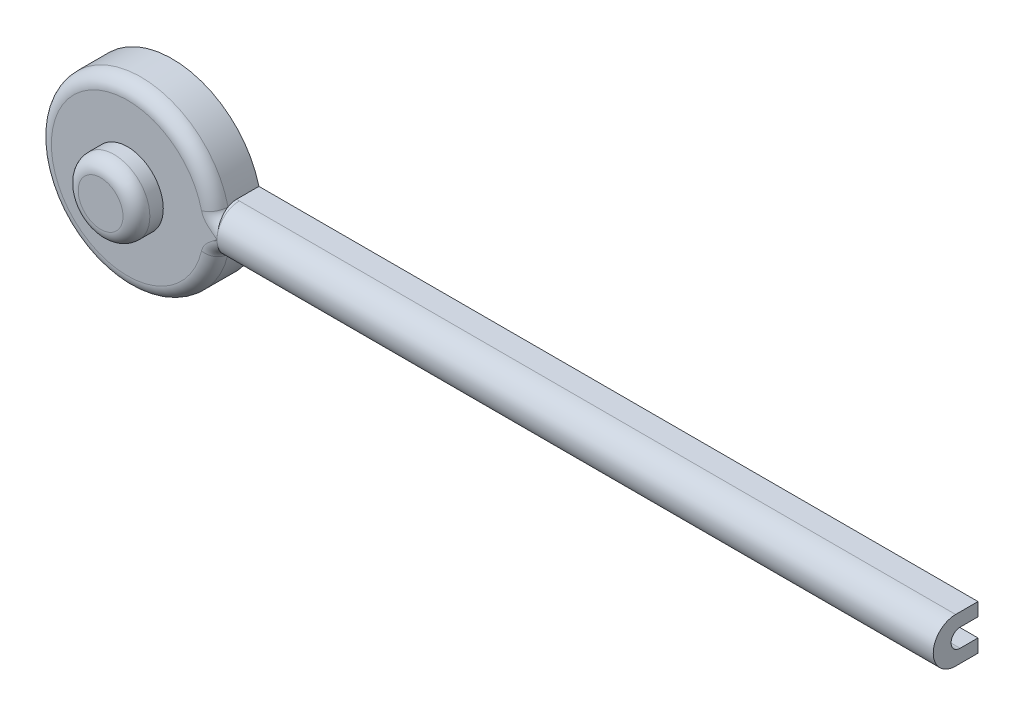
ISO-10303-21;
HEADER;
FILE_DESCRIPTION(('STEP AP214'),'2;1');
FILE_NAME('part.step','',(''),(''),'','','');
FILE_SCHEMA(('AUTOMOTIVE_DESIGN { 1 0 10303 214 1 1 1 1 }'));
ENDSEC;
DATA;
#1=APPLICATION_CONTEXT('core data for automotive mechanical design processes');
#2=APPLICATION_PROTOCOL_DEFINITION('international standard','automotive_design',2000,#1);
#3=PRODUCT_CONTEXT('',#1,'mechanical');
#4=PRODUCT('Part','Part','',(#3));
#5=PRODUCT_RELATED_PRODUCT_CATEGORY('part','',(#4));
#6=PRODUCT_DEFINITION_FORMATION('','',#4);
#7=PRODUCT_DEFINITION_CONTEXT('part definition',#1,'design');
#8=PRODUCT_DEFINITION('design','',#6,#7);
#9=PRODUCT_DEFINITION_SHAPE('','',#8);
#10=(LENGTH_UNIT() NAMED_UNIT(*) SI_UNIT(.MILLI.,.METRE.));
#11=(NAMED_UNIT(*) PLANE_ANGLE_UNIT() SI_UNIT($,.RADIAN.));
#12=(NAMED_UNIT(*) SI_UNIT($,.STERADIAN.) SOLID_ANGLE_UNIT());
#13=UNCERTAINTY_MEASURE_WITH_UNIT(LENGTH_MEASURE(1.E-05),#10,'distance_accuracy_value','');
#14=(GEOMETRIC_REPRESENTATION_CONTEXT(3) GLOBAL_UNCERTAINTY_ASSIGNED_CONTEXT((#13)) GLOBAL_UNIT_ASSIGNED_CONTEXT((#10,
#11,#12)) REPRESENTATION_CONTEXT('',''));
#15=CARTESIAN_POINT('',(0.,0.,0.));
#16=DIRECTION('',(0.,0.,1.));
#17=DIRECTION('',(1.,0.,0.));
#18=AXIS2_PLACEMENT_3D('',#15,#16,#17);
#19=CARTESIAN_POINT('',(0.,0.,0.));
#20=DIRECTION('',(0.,0.,1.));
#21=DIRECTION('',(1.,0.,0.));
#22=AXIS2_PLACEMENT_3D('',#19,#20,#21);
#23=PLANE('',#22);
#24=DIRECTION('',(1.,0.,0.));
#25=VECTOR('',#24,1.);
#26=CARTESIAN_POINT('',(0.,-0.51,0.));
#27=LINE('',#26,#25);
#28=CARTESIAN_POINT('',(1.67403703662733,-0.51,0.));
#29=VERTEX_POINT('',#28);
#30=CARTESIAN_POINT('',(45.,-0.51,0.));
#31=VERTEX_POINT('',#30);
#32=EDGE_CURVE('E156',#29,#31,#27,.T.);
#33=ORIENTED_EDGE('',*,*,#32,.T.);
#34=DIRECTION('',(0.,1.,0.));
#35=VECTOR('',#34,1.);
#36=CARTESIAN_POINT('',(45.,1.25,0.));
#37=LINE('',#36,#35);
#38=CARTESIAN_POINT('',(45.,-1.25,0.));
#39=VERTEX_POINT('',#38);
#40=EDGE_CURVE('E175',#39,#31,#37,.T.);
#41=ORIENTED_EDGE('',*,*,#40,.F.);
#42=DIRECTION('',(-1.,0.,0.));
#43=VECTOR('',#42,1.);
#44=CARTESIAN_POINT('',(5.,-1.25,0.));
#45=LINE('',#44,#43);
#46=CARTESIAN_POINT('',(4.84122918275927,-1.25,0.));
#47=VERTEX_POINT('',#46);
#48=EDGE_CURVE('E189',#39,#47,#45,.T.);
#49=ORIENTED_EDGE('',*,*,#48,.T.);
#50=CARTESIAN_POINT('',(0.,0.,0.));
#51=DIRECTION('',(0.,0.,1.));
#52=DIRECTION('',(1.,0.,0.));
#53=AXIS2_PLACEMENT_3D('',#50,#51,#52);
#54=CIRCLE('',#53,5.);
#55=CARTESIAN_POINT('',(4.84122918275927,1.25,0.));
#56=VERTEX_POINT('',#55);
#57=EDGE_CURVE('E199',#56,#47,#54,.T.);
#58=ORIENTED_EDGE('',*,*,#57,.F.);
#59=DIRECTION('',(1.,0.,0.));
#60=VECTOR('',#59,1.);
#61=CARTESIAN_POINT('',(5.,1.25,0.));
#62=LINE('',#61,#60);
#63=CARTESIAN_POINT('',(45.,1.25,0.));
#64=VERTEX_POINT('',#63);
#65=EDGE_CURVE('E192',#56,#64,#62,.T.);
#66=ORIENTED_EDGE('',*,*,#65,.T.);
#67=CARTESIAN_POINT('',(45.,0.51,0.));
#68=VERTEX_POINT('',#67);
#69=EDGE_CURVE('E155',#68,#64,#37,.T.);
#70=ORIENTED_EDGE('',*,*,#69,.F.);
#71=DIRECTION('',(1.,0.,0.));
#72=VECTOR('',#71,1.);
#73=CARTESIAN_POINT('',(0.,0.51,0.));
#74=LINE('',#73,#72);
#75=CARTESIAN_POINT('',(1.67403703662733,0.51,0.));
#76=VERTEX_POINT('',#75);
#77=EDGE_CURVE('E140',#76,#68,#74,.T.);
#78=ORIENTED_EDGE('',*,*,#77,.F.);
#79=CARTESIAN_POINT('',(0.,0.,0.));
#80=DIRECTION('',(0.,0.,-1.));
#81=DIRECTION('',(-1.,0.,0.));
#82=AXIS2_PLACEMENT_3D('',#79,#80,#81);
#83=CIRCLE('',#82,1.75);
#84=EDGE_CURVE('E153',#29,#76,#83,.T.);
#85=ORIENTED_EDGE('',*,*,#84,.F.);
#86=EDGE_LOOP('',(#33,#41,#49,#58,#66,#70,#78,#85));
#87=FACE_BOUND('',#86,.T.);
#88=ADVANCED_FACE('F35',(#87),#23,.F.);
#89=CARTESIAN_POINT('',(45.,0.,1.25));
#90=DIRECTION('',(1.,0.,0.));
#91=DIRECTION('',(0.,0.,-1.));
#92=AXIS2_PLACEMENT_3D('',#89,#90,#91);
#93=PLANE('',#92);
#94=ORIENTED_EDGE('',*,*,#40,.T.);
#95=DIRECTION('',(0.,0.,-1.));
#96=VECTOR('',#95,1.);
#97=CARTESIAN_POINT('',(45.,-0.51,1.5));
#98=LINE('',#97,#96);
#99=CARTESIAN_POINT('',(45.,-0.51,1.));
#100=VERTEX_POINT('',#99);
#101=EDGE_CURVE('E166',#100,#31,#98,.T.);
#102=ORIENTED_EDGE('',*,*,#101,.F.);
#103=CARTESIAN_POINT('',(45.,-0.01,1.));
#104=DIRECTION('',(1.,0.,0.));
#105=DIRECTION('',(0.,0.,-1.));
#106=AXIS2_PLACEMENT_3D('',#103,#104,#105);
#107=CIRCLE('',#106,0.5);
#108=CARTESIAN_POINT('',(45.,-0.01,1.5));
#109=VERTEX_POINT('',#108);
#110=EDGE_CURVE('E48',#100,#109,#107,.F.);
#111=ORIENTED_EDGE('',*,*,#110,.T.);
#112=DIRECTION('',(0.,-1.,0.));
#113=VECTOR('',#112,1.);
#114=CARTESIAN_POINT('',(45.,0.,1.5));
#115=LINE('',#114,#113);
#116=CARTESIAN_POINT('',(45.,0.01,1.5));
#117=VERTEX_POINT('',#116);
#118=EDGE_CURVE('E148',#117,#109,#115,.T.);
#119=ORIENTED_EDGE('',*,*,#118,.F.);
#120=CARTESIAN_POINT('',(45.,0.01,1.));
#121=DIRECTION('',(1.,0.,0.));
#122=DIRECTION('',(0.,0.,-1.));
#123=AXIS2_PLACEMENT_3D('',#120,#121,#122);
#124=CIRCLE('',#123,0.5);
#125=CARTESIAN_POINT('',(45.,0.51,1.));
#126=VERTEX_POINT('',#125);
#127=EDGE_CURVE('E320',#117,#126,#124,.F.);
#128=ORIENTED_EDGE('',*,*,#127,.T.);
#129=DIRECTION('',(0.,0.,-1.));
#130=VECTOR('',#129,1.);
#131=CARTESIAN_POINT('',(45.,0.51,1.5));
#132=LINE('',#131,#130);
#133=EDGE_CURVE('E147',#126,#68,#132,.T.);
#134=ORIENTED_EDGE('',*,*,#133,.T.);
#135=ORIENTED_EDGE('',*,*,#69,.T.);
#136=DIRECTION('',(0.,0.,1.));
#137=VECTOR('',#136,1.);
#138=CARTESIAN_POINT('',(45.,1.25,1.25));
#139=LINE('',#138,#137);
#140=CARTESIAN_POINT('',(45.,1.25,1.25));
#141=VERTEX_POINT('',#140);
#142=EDGE_CURVE('E178',#64,#141,#139,.T.);
#143=ORIENTED_EDGE('',*,*,#142,.T.);
#144=CARTESIAN_POINT('',(45.,0.,1.25));
#145=DIRECTION('',(1.,0.,0.));
#146=DIRECTION('',(0.,0.,-1.));
#147=AXIS2_PLACEMENT_3D('',#144,#145,#146);
#148=CIRCLE('',#147,1.25);
#149=CARTESIAN_POINT('',(45.,-1.25,1.25));
#150=VERTEX_POINT('',#149);
#151=EDGE_CURVE('E169',#141,#150,#148,.T.);
#152=ORIENTED_EDGE('',*,*,#151,.T.);
#153=DIRECTION('',(0.,0.,-1.));
#154=VECTOR('',#153,1.);
#155=CARTESIAN_POINT('',(45.,-1.25,1.25));
#156=LINE('',#155,#154);
#157=EDGE_CURVE('E172',#150,#39,#156,.T.);
#158=ORIENTED_EDGE('',*,*,#157,.T.);
#159=EDGE_LOOP('',(#94,#102,#111,#119,#128,#134,#135,#143,#152,#158));
#160=FACE_BOUND('',#159,.T.);
#161=ADVANCED_FACE('F326',(#160),#93,.T.);
#162=CARTESIAN_POINT('',(0.,0.,1.5));
#163=DIRECTION('',(0.,0.,-1.));
#164=DIRECTION('',(-1.,0.,0.));
#165=AXIS2_PLACEMENT_3D('',#162,#163,#164);
#166=CYLINDRICAL_SURFACE('',#165,1.75);
#167=CARTESIAN_POINT('',(0.,0.,1.5));
#168=DIRECTION('',(0.,0.,-1.));
#169=DIRECTION('',(-1.,0.,0.));
#170=AXIS2_PLACEMENT_3D('',#167,#168,#169);
#171=CIRCLE('',#170,1.75);
#172=CARTESIAN_POINT('',(1.74997142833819,-0.00999999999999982,1.5));
#173=VERTEX_POINT('',#172);
#174=CARTESIAN_POINT('',(1.74997142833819,0.00999999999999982,1.5));
#175=VERTEX_POINT('',#174);
#176=EDGE_CURVE('E162',#173,#175,#171,.T.);
#177=ORIENTED_EDGE('',*,*,#176,.F.);
#178=CARTESIAN_POINT('',(1.74997142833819,-0.00999999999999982,1.5));
#179=CARTESIAN_POINT('',(1.74983773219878,-0.0375680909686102,1.50002631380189));
#180=CARTESIAN_POINT('',(1.74900582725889,-0.065112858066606,1.49772187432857));
#181=CARTESIAN_POINT('',(1.74613085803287,-0.119331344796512,1.48866453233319));
#182=CARTESIAN_POINT('',(1.74409068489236,-0.146006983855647,1.48192224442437));
#183=CARTESIAN_POINT('',(1.73898254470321,-0.197796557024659,1.46420209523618));
#184=CARTESIAN_POINT('',(1.73591477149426,-0.222910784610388,1.45322503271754));
#185=CARTESIAN_POINT('',(1.7290677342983,-0.270947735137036,1.42737595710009));
#186=CARTESIAN_POINT('',(1.72528819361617,-0.293869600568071,1.41250242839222));
#187=CARTESIAN_POINT('',(1.71729837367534,-0.337476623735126,1.37886109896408));
#188=CARTESIAN_POINT('',(1.71307990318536,-0.358094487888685,1.36000801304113));
#189=CARTESIAN_POINT('',(1.70473468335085,-0.395923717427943,1.31912177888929));
#190=CARTESIAN_POINT('',(1.7006079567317,-0.41313424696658,1.29708785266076));
#191=CARTESIAN_POINT('',(1.69281812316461,-0.443988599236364,1.24992736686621));
#192=CARTESIAN_POINT('',(1.68916589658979,-0.45755449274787,1.22474791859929));
#193=CARTESIAN_POINT('',(1.68286236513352,-0.480222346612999,1.1723486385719));
#194=CARTESIAN_POINT('',(1.6802101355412,-0.489328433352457,1.14513071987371));
#195=CARTESIAN_POINT('',(1.67685816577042,-0.500669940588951,1.09814309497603));
#196=CARTESIAN_POINT('',(1.675807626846,-0.504161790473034,1.07869270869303));
#197=CARTESIAN_POINT('',(1.67439380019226,-0.508829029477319,1.03949879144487));
#198=CARTESIAN_POINT('',(1.67403027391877,-0.510005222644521,1.01975536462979));
#199=CARTESIAN_POINT('',(1.67403703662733,-0.51,1.));
#200=B_SPLINE_CURVE_WITH_KNOTS('',3,(#178,#179,#180,#181,#182,#183,#184,#185,#186,#187,#188,
#189,#190,#191,#192,#193,#194,#195,#196,#197,#198,#199),.UNSPECIFIED.,.F.,.F.,(4,2,2,2,2,2,2,2,
2,2,4),(0.,0.0825710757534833,0.164945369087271,0.247304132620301,0.329694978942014,
0.414073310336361,0.498472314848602,0.584553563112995,0.670555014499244,0.729781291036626,
0.788986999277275),.UNSPECIFIED.);
#201=CARTESIAN_POINT('',(1.67403703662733,-0.51,1.));
#202=VERTEX_POINT('',#201);
#203=EDGE_CURVE('E11',#173,#202,#200,.T.);
#204=ORIENTED_EDGE('',*,*,#203,.T.);
#205=DIRECTION('',(0.,0.,-1.));
#206=VECTOR('',#205,1.);
#207=CARTESIAN_POINT('',(1.67403703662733,-0.51,1.5));
#208=LINE('',#207,#206);
#209=EDGE_CURVE('E160',#202,#29,#208,.T.);
#210=ORIENTED_EDGE('',*,*,#209,.T.);
#211=ORIENTED_EDGE('',*,*,#84,.T.);
#212=DIRECTION('',(0.,0.,-1.));
#213=VECTOR('',#212,1.);
#214=CARTESIAN_POINT('',(1.67403703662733,0.51,1.5));
#215=LINE('',#214,#213);
#216=CARTESIAN_POINT('',(1.67403703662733,0.51,1.));
#217=VERTEX_POINT('',#216);
#218=EDGE_CURVE('E136',#217,#76,#215,.T.);
#219=ORIENTED_EDGE('',*,*,#218,.F.);
#220=CARTESIAN_POINT('',(1.67403703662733,0.51,1.));
#221=CARTESIAN_POINT('',(1.67400963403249,0.510026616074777,1.02748834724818));
#222=CARTESIAN_POINT('',(1.67472695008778,0.507735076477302,1.05495568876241));
#223=CARTESIAN_POINT('',(1.67744097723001,0.49872908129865,1.10902146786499));
#224=CARTESIAN_POINT('',(1.67943441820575,0.492025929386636,1.13562194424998));
#225=CARTESIAN_POINT('',(1.68449192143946,0.47441060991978,1.18726793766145));
#226=CARTESIAN_POINT('',(1.68755568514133,0.463499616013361,1.2123138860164));
#227=CARTESIAN_POINT('',(1.69440370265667,0.437805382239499,1.26023399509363));
#228=CARTESIAN_POINT('',(1.69818828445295,0.423020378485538,1.28310716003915));
#229=CARTESIAN_POINT('',(1.70618540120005,0.38953113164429,1.32669824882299));
#230=CARTESIAN_POINT('',(1.71040667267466,0.37073267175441,1.3473421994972));
#231=CARTESIAN_POINT('',(1.71873934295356,0.329950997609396,1.38523526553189));
#232=CARTESIAN_POINT('',(1.72285071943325,0.307967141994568,1.40248369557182));
#233=CARTESIAN_POINT('',(1.73061148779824,0.260890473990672,1.43343235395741));
#234=CARTESIAN_POINT('',(1.73424972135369,0.235743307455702,1.44705286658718));
#235=CARTESIAN_POINT('',(1.74056214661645,0.18340164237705,1.46983497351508));
#236=CARTESIAN_POINT('',(1.7432371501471,0.156208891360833,1.47900032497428));
#237=CARTESIAN_POINT('',(1.74670543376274,0.109069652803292,1.49049130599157));
#238=CARTESIAN_POINT('',(1.74782369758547,0.0894389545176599,1.49404994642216));
#239=CARTESIAN_POINT('',(1.74940251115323,0.0498766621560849,1.4988064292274));
#240=CARTESIAN_POINT('',(1.74986334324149,0.0299452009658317,1.50000528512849));
#241=CARTESIAN_POINT('',(1.74997142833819,0.00999999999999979,1.5));
#242=B_SPLINE_CURVE_WITH_KNOTS('',3,(#220,#221,#222,#223,#224,#225,#226,#227,#228,#229,#230,
#231,#232,#233,#234,#235,#236,#237,#238,#239,#240,#241),.UNSPECIFIED.,.F.,.F.,(4,2,2,2,2,2,2,2,
2,2,4),(0.,0.082327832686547,0.164445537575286,0.246540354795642,0.328672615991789,
0.413000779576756,0.497345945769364,0.583414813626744,0.669410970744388,0.729212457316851,
0.788988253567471),.UNSPECIFIED.);
#243=EDGE_CURVE('E315',#217,#175,#242,.T.);
#244=ORIENTED_EDGE('',*,*,#243,.T.);
#245=EDGE_LOOP('',(#177,#204,#210,#211,#219,#244));
#246=FACE_BOUND('',#245,.T.);
#247=ADVANCED_FACE('F159',(#246),#166,.F.);
#248=CARTESIAN_POINT('',(0.,0.,2.5));
#249=DIRECTION('',(0.,0.,-1.));
#250=DIRECTION('',(-1.,0.,0.));
#251=AXIS2_PLACEMENT_3D('',#248,#249,#250);
#252=CYLINDRICAL_SURFACE('',#251,5.);
#253=CARTESIAN_POINT('',(4.84122918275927,-1.25,1.25));
#254=CARTESIAN_POINT('',(4.84122685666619,-1.25000042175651,1.2845798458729));
#255=CARTESIAN_POINT('',(4.84160014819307,-1.24856416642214,1.31914255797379));
#256=CARTESIAN_POINT('',(4.84307392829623,-1.24283865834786,1.38800947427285));
#257=CARTESIAN_POINT('',(4.84417429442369,-1.2385498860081,1.42231372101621));
#258=CARTESIAN_POINT('',(4.84852166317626,-1.22146795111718,1.52432079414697));
#259=CARTESIAN_POINT('',(4.85281521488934,-1.20445888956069,1.59132268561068));
#260=CARTESIAN_POINT('',(4.86369270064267,-1.15974793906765,1.72140486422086));
#261=CARTESIAN_POINT('',(4.87027645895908,-1.13204687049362,1.78448545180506));
#262=CARTESIAN_POINT('',(4.88498893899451,-1.06677031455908,1.90513759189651));
#263=CARTESIAN_POINT('',(4.89311812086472,-1.02919188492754,1.96270749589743));
#264=CARTESIAN_POINT('',(4.91020314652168,-0.94435635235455,2.0719290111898));
#265=CARTESIAN_POINT('',(4.91917210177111,-0.896923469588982,2.1234419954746));
#266=CARTESIAN_POINT('',(4.9368135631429,-0.794095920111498,2.21787639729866));
#267=CARTESIAN_POINT('',(4.94548601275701,-0.738699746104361,2.26079618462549));
#268=CARTESIAN_POINT('',(4.96170457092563,-0.620555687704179,2.33739962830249));
#269=CARTESIAN_POINT('',(4.96923290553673,-0.55771444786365,2.37094323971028));
#270=CARTESIAN_POINT('',(4.98215773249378,-0.427082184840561,2.42692002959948));
#271=CARTESIAN_POINT('',(4.98755587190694,-0.359295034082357,2.44936179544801));
#272=CARTESIAN_POINT('',(4.99433622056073,-0.242622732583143,2.4771983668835));
#273=CARTESIAN_POINT('',(4.99644773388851,-0.194506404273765,2.48573578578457));
#274=CARTESIAN_POINT('',(4.99928499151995,-0.097601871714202,2.4971401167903));
#275=CARTESIAN_POINT('',(5.00001172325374,-0.0488141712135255,2.50001106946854));
#276=CARTESIAN_POINT('',(5.,0.,2.5));
#277=B_SPLINE_CURVE_WITH_KNOTS('',3,(#253,#254,#255,#256,#257,#258,#259,#260,#261,#262,#263,
#264,#265,#266,#267,#268,#269,#270,#271,#272,#273,#274,#275,#276),.UNSPECIFIED.,.F.,.F.,(4,2,2,
2,2,2,2,2,2,2,2,4),(0.,0.103674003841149,0.207330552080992,0.414037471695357,0.620728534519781,
0.827481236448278,1.03829924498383,1.24915720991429,1.46301414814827,1.67670540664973,
1.82311290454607,1.9694159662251),.UNSPECIFIED.);
#278=CARTESIAN_POINT('',(4.84122918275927,-1.25,1.25));
#279=VERTEX_POINT('',#278);
#280=CARTESIAN_POINT('',(4.86698058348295,-1.14564392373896,1.75));
#281=VERTEX_POINT('',#280);
#282=EDGE_CURVE('E220',#279,#281,#277,.T.);
#283=ORIENTED_EDGE('',*,*,#282,.T.);
#284=CARTESIAN_POINT('',(0.,0.,1.75));
#285=DIRECTION('',(0.,0.,1.));
#286=DIRECTION('',(1.,0.,0.));
#287=AXIS2_PLACEMENT_3D('',#284,#285,#286);
#288=CIRCLE('',#287,5.);
#289=CARTESIAN_POINT('',(4.86698058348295,1.14564392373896,1.75));
#290=VERTEX_POINT('',#289);
#291=EDGE_CURVE('E478',#281,#290,#288,.F.);
#292=ORIENTED_EDGE('',*,*,#291,.T.);
#293=CARTESIAN_POINT('',(5.,0.,2.5));
#294=CARTESIAN_POINT('',(5.00000197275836,0.0345969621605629,2.50000037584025));
#295=CARTESIAN_POINT('',(4.99964047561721,0.0691768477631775,2.49856274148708));
#296=CARTESIAN_POINT('',(4.99821154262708,0.138079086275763,2.49283144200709));
#297=CARTESIAN_POINT('',(4.99714421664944,0.172401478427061,2.48853822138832));
#298=CARTESIAN_POINT('',(4.99292284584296,0.274469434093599,2.47143701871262));
#299=CARTESIAN_POINT('',(4.98874916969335,0.341515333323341,2.45440722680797));
#300=CARTESIAN_POINT('',(4.9781309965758,0.471688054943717,2.40963597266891));
#301=CARTESIAN_POINT('',(4.97168654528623,0.534814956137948,2.38189472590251));
#302=CARTESIAN_POINT('',(4.95721298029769,0.655543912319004,2.31652419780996));
#303=CARTESIAN_POINT('',(4.94918345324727,0.713144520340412,2.27889233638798));
#304=CARTESIAN_POINT('',(4.9322289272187,0.822332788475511,2.19400174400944));
#305=CARTESIAN_POINT('',(4.92329021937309,0.873790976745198,2.14657929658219));
#306=CARTESIAN_POINT('',(4.90561442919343,0.96811928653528,2.04379539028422));
#307=CARTESIAN_POINT('',(4.89687739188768,1.01098750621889,1.98843217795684));
#308=CARTESIAN_POINT('',(4.88045384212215,1.0875344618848,1.8703197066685));
#309=CARTESIAN_POINT('',(4.87278522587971,1.12106433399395,1.80747136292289));
#310=CARTESIAN_POINT('',(4.85957521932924,1.17701315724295,1.67682526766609));
#311=CARTESIAN_POINT('',(4.85403210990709,1.19944109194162,1.60903156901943));
#312=CARTESIAN_POINT('',(4.84706274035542,1.227240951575,1.49239681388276));
#313=CARTESIAN_POINT('',(4.84488929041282,1.23576197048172,1.44432772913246));
#314=CARTESIAN_POINT('',(4.84196633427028,1.24714522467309,1.34751444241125));
#315=CARTESIAN_POINT('',(4.84121589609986,1.25001116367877,1.29877070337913));
#316=CARTESIAN_POINT('',(4.84122918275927,1.25,1.25));
#317=B_SPLINE_CURVE_WITH_KNOTS('',3,(#293,#294,#295,#296,#297,#298,#299,#300,#301,#302,#303,
#304,#305,#306,#307,#308,#309,#310,#311,#312,#313,#314,#315,#316),.UNSPECIFIED.,.F.,.F.,(4,2,2,
2,2,2,2,2,2,2,2,4),(0.,0.103725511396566,0.207434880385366,0.414262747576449,0.621086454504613,
0.827964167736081,1.03863143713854,1.24934529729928,1.46324753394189,1.67697639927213,
1.82324395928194,1.96941569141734),.UNSPECIFIED.);
#318=CARTESIAN_POINT('',(4.84122918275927,1.25,1.25));
#319=VERTEX_POINT('',#318);
#320=EDGE_CURVE('E210',#290,#319,#317,.T.);
#321=ORIENTED_EDGE('',*,*,#320,.T.);
#322=DIRECTION('',(0.,0.,-1.));
#323=VECTOR('',#322,1.);
#324=CARTESIAN_POINT('',(4.84122918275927,1.25,2.5));
#325=LINE('',#324,#323);
#326=EDGE_CURVE('E197',#319,#56,#325,.T.);
#327=ORIENTED_EDGE('',*,*,#326,.T.);
#328=ORIENTED_EDGE('',*,*,#57,.T.);
#329=DIRECTION('',(0.,0.,-1.));
#330=VECTOR('',#329,1.);
#331=CARTESIAN_POINT('',(4.84122918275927,-1.25,2.5));
#332=LINE('',#331,#330);
#333=EDGE_CURVE('E194',#47,#279,#332,.F.);
#334=ORIENTED_EDGE('',*,*,#333,.T.);
#335=EDGE_LOOP('',(#283,#292,#321,#327,#328,#334));
#336=FACE_BOUND('',#335,.T.);
#337=ADVANCED_FACE('F226',(#336),#252,.T.);
#338=CARTESIAN_POINT('',(0.,0.,2.5));
#339=DIRECTION('',(0.,0.,1.));
#340=DIRECTION('',(1.,0.,0.));
#341=AXIS2_PLACEMENT_3D('',#338,#339,#340);
#342=PLANE('',#341);
#343=CARTESIAN_POINT('',(5.,0.,2.5));
#344=CARTESIAN_POINT('',(5.,0.,2.5));
#345=CARTESIAN_POINT('',(5.,0.,2.5));
#346=CARTESIAN_POINT('',(5.00036324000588,-0.000901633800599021,2.5));
#347=CARTESIAN_POINT('',(5.00018188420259,-0.00107424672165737,2.5));
#348=CARTESIAN_POINT('',(5.00000052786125,-0.00124685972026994,2.49999999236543));
#349=CARTESIAN_POINT('',(5.00006912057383,-0.00123835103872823,2.5));
#350=CARTESIAN_POINT('',(5.00003495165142,-0.00154951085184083,2.5));
#351=CARTESIAN_POINT('',(5.00000078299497,-0.00186067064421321,2.49999997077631));
#352=CARTESIAN_POINT('',(4.99946752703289,-0.00159019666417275,2.5));
#353=CARTESIAN_POINT('',(4.99973420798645,-0.00214285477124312,2.5));
#354=CARTESIAN_POINT('',(5.00000088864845,-0.00269551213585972,2.49999901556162));
#355=CARTESIAN_POINT('',(4.99926896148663,-0.00167813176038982,2.5));
#356=CARTESIAN_POINT('',(4.9996349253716,-0.00230699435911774,2.5));
#357=CARTESIAN_POINT('',(5.00000088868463,-0.0029358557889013,2.49999862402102));
#358=CARTESIAN_POINT('',(4.99889183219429,-0.00189703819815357,2.5));
#359=CARTESIAN_POINT('',(4.99944633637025,-0.00270323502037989,2.5));
#360=CARTESIAN_POINT('',(5.00000083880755,-0.00350942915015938,2.4999974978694));
#361=CARTESIAN_POINT('',(4.99871483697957,-0.00203000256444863,2.5));
#362=CARTESIAN_POINT('',(4.99935781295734,-0.00293841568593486,2.5));
#363=CARTESIAN_POINT('',(5.00000078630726,-0.00384682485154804,2.49999674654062));
#364=CARTESIAN_POINT('',(4.99833613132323,-0.00231129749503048,2.5));
#365=CARTESIAN_POINT('',(4.99916836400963,-0.00343867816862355,2.5));
#366=CARTESIAN_POINT('',(5.0000005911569,-0.00456605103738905,2.49999482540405));
#367=CARTESIAN_POINT('',(4.99813416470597,-0.00245940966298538,2.5));
#368=CARTESIAN_POINT('',(4.99906730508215,-0.00370372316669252,2.5));
#369=CARTESIAN_POINT('',(5.00000043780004,-0.00494802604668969,2.49999361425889));
#370=CARTESIAN_POINT('',(4.9977401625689,-0.00275642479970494,2.5));
#371=CARTESIAN_POINT('',(4.99887010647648,-0.00423438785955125,2.5));
#372=CARTESIAN_POINT('',(5.0000000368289,-0.00571233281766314,2.49999082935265));
#373=CARTESIAN_POINT('',(4.99754801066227,-0.00290517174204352,2.5));
#374=CARTESIAN_POINT('',(4.99877391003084,-0.00449975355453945,2.5));
#375=CARTESIAN_POINT('',(4.99999979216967,-0.00609431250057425,2.4999892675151));
#376=CARTESIAN_POINT('',(4.99725343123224,-0.00313210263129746,2.5));
#377=CARTESIAN_POINT('',(4.99862640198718,-0.00490486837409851,2.5));
#378=CARTESIAN_POINT('',(4.9999993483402,-0.00667760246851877,2.49998661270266));
#379=CARTESIAN_POINT('',(4.99715102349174,-0.00321078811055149,2.5));
#380=CARTESIAN_POINT('',(4.99857511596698,-0.00504538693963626,2.5));
#381=CARTESIAN_POINT('',(4.99999918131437,-0.00687995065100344,2.49998564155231));
#382=CARTESIAN_POINT('',(4.99695303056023,-0.00336668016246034,2.5));
#383=CARTESIAN_POINT('',(4.99847594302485,-0.00532377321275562,2.5));
#384=CARTESIAN_POINT('',(4.99999882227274,-0.0072808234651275,2.49998360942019));
#385=CARTESIAN_POINT('',(4.99685739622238,-0.00344370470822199,2.5));
#386=CARTESIAN_POINT('',(4.99842803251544,-0.00546131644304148,2.5));
#387=CARTESIAN_POINT('',(4.99999863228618,-0.00747888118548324,2.49998255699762));
#388=CARTESIAN_POINT('',(4.99670569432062,-0.00355652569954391,2.5));
#389=CARTESIAN_POINT('',(4.99835203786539,-0.0056628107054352,2.5));
#390=CARTESIAN_POINT('',(4.99999833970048,-0.00776904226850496,2.49998096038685));
#391=CARTESIAN_POINT('',(4.99665037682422,-0.00359576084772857,2.5));
#392=CARTESIAN_POINT('',(4.99832432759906,-0.00573288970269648,2.5));
#393=CARTESIAN_POINT('',(4.99999823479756,-0.00786996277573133,2.49998039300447));
#394=CARTESIAN_POINT('',(4.99654973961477,-0.00368587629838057,2.5));
#395=CARTESIAN_POINT('',(4.99827388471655,-0.00589382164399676,2.5));
#396=CARTESIAN_POINT('',(4.99999798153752,-0.00810170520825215,2.49997904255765));
#397=CARTESIAN_POINT('',(4.99650399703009,-0.00373493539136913,2.5));
#398=CARTESIAN_POINT('',(4.99825094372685,-0.00598142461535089,2.5));
#399=CARTESIAN_POINT('',(4.99999783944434,-0.00822784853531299,2.4999782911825));
#400=CARTESIAN_POINT('',(4.99623795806,-0.00384775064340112,2.5));
#401=CARTESIAN_POINT('',(4.99811776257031,-0.00618307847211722,2.5));
#402=CARTESIAN_POINT('',(4.99999751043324,-0.00851833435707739,2.49997655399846));
#403=CARTESIAN_POINT('',(4.99591793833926,-0.00348083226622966,2.5));
#404=CARTESIAN_POINT('',(4.99795826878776,-0.00552872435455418,2.5));
#405=CARTESIAN_POINT('',(4.99999856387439,-0.0075765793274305,2.49998213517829));
#406=CARTESIAN_POINT('',(4.9954977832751,-0.00342847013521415,2.5));
#407=CARTESIAN_POINT('',(4.99774821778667,-0.00543587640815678,2.5));
#408=CARTESIAN_POINT('',(4.99999861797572,-0.00744325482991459,2.49998255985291));
#409=CARTESIAN_POINT('',(4.99562624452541,-0.00424933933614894,2.5));
#410=CARTESIAN_POINT('',(4.99781121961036,-0.00690063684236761,2.5));
#411=CARTESIAN_POINT('',(4.99999611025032,-0.00955182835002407,2.49996949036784));
#412=CARTESIAN_POINT('',(4.99530628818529,-0.00471275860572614,2.5));
#413=CARTESIAN_POINT('',(4.99765039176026,-0.00772826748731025,2.5));
#414=CARTESIAN_POINT('',(4.99999437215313,-0.0107436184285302,2.4999608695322));
#415=CARTESIAN_POINT('',(4.99517801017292,-0.00477424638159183,2.5));
#416=CARTESIAN_POINT('',(4.99758610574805,-0.00783823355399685,2.5));
#417=CARTESIAN_POINT('',(4.99999407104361,-0.0109020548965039,2.49995945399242));
#418=CARTESIAN_POINT('',(4.99494524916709,-0.00492796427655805,2.5));
#419=CARTESIAN_POINT('',(4.99746937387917,-0.00811301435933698,2.5));
#420=CARTESIAN_POINT('',(4.99999335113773,-0.0112978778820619,2.49995604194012));
#421=CARTESIAN_POINT('',(4.99484072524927,-0.00502014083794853,2.5));
#422=CARTESIAN_POINT('',(4.99741690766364,-0.00827773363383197,2.5));
#423=CARTESIAN_POINT('',(4.9999929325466,-0.0115351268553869,2.49995404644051));
#424=CARTESIAN_POINT('',(4.99451874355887,-0.00529011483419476,2.5));
#425=CARTESIAN_POINT('',(4.99725528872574,-0.00876023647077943,2.5));
#426=CARTESIAN_POINT('',(4.99999164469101,-0.0122301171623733,2.49994796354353));
#427=CARTESIAN_POINT('',(4.99429478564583,-0.00545940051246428,2.5));
#428=CARTESIAN_POINT('',(4.99714287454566,-0.00906287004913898,2.5));
#429=CARTESIAN_POINT('',(4.99999075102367,-0.0126660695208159,2.499943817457));
#430=CARTESIAN_POINT('',(4.99387804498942,-0.00578416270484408,2.5));
#431=CARTESIAN_POINT('',(4.99693361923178,-0.00964350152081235,2.5));
#432=CARTESIAN_POINT('',(4.99998893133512,-0.0135025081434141,2.49993545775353));
#433=CARTESIAN_POINT('',(4.99368470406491,-0.00593890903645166,2.5));
#434=CARTESIAN_POINT('',(4.99683650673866,-0.00992018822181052,2.5));
#435=CARTESIAN_POINT('',(4.99998802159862,-0.0139011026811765,2.49993130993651));
#436=CARTESIAN_POINT('',(4.99329683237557,-0.00624727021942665,2.5));
#437=CARTESIAN_POINT('',(4.9966416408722,-0.0104716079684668,2.5));
#438=CARTESIAN_POINT('',(4.99998610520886,-0.0146955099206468,2.49992264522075));
#439=CARTESIAN_POINT('',(4.99310230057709,-0.00640088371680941,2.5));
#440=CARTESIAN_POINT('',(4.99654388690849,-0.0107463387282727,2.5));
#441=CARTESIAN_POINT('',(4.99998509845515,-0.0150913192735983,2.49991812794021));
#442=CARTESIAN_POINT('',(4.99254773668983,-0.00683950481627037,2.5));
#443=CARTESIAN_POINT('',(4.99626514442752,-0.0115308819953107,2.5));
#444=CARTESIAN_POINT('',(4.99998208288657,-0.0162216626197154,2.49990468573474));
#445=CARTESIAN_POINT('',(4.99218799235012,-0.00712488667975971,2.5));
#446=CARTESIAN_POINT('',(4.99608424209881,-0.012041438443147,2.5));
#447=CARTESIAN_POINT('',(4.99997995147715,-0.0169573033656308,2.49989528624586));
#448=CARTESIAN_POINT('',(4.99149209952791,-0.00767665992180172,2.5));
#449=CARTESIAN_POINT('',(4.99573414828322,-0.0130287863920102,2.5));
#450=CARTESIAN_POINT('',(4.99997549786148,-0.0183800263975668,2.49987582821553));
#451=CARTESIAN_POINT('',(4.99115595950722,-0.00794306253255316,2.5));
#452=CARTESIAN_POINT('',(4.99556497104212,-0.0135055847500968,2.5));
#453=CARTESIAN_POINT('',(4.99997319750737,-0.0190671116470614,2.49986585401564));
#454=CARTESIAN_POINT('',(4.99047583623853,-0.00848210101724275,2.5));
#455=CARTESIAN_POINT('',(4.99522252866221,-0.0144705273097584,2.5));
#456=CARTESIAN_POINT('',(4.99996824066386,-0.0204577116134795,2.49984450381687));
#457=CARTESIAN_POINT('',(4.99013185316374,-0.00875473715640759,2.5));
#458=CARTESIAN_POINT('',(4.99504926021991,-0.0149586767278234,2.5));
#459=CARTESIAN_POINT('',(4.9999655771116,-0.0211612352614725,2.4998331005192));
#460=CARTESIAN_POINT('',(4.9891577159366,-0.00952680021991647,2.5));
#461=CARTESIAN_POINT('',(4.99455836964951,-0.0163413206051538,2.5));
#462=CARTESIAN_POINT('',(4.99995759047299,-0.0231540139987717,2.49979909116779));
#463=CARTESIAN_POINT('',(4.98852755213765,-0.0100262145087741,2.5));
#464=CARTESIAN_POINT('',(4.99424057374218,-0.0172360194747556,2.5));
#465=CARTESIAN_POINT('',(4.99995189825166,-0.0244436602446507,2.49977505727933));
#466=CARTESIAN_POINT('',(4.98727164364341,-0.0110212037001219,2.5));
#467=CARTESIAN_POINT('',(4.99360673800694,-0.0190191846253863,2.5));
#468=CARTESIAN_POINT('',(4.99993950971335,-0.0270142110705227,2.49972311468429));
#469=CARTESIAN_POINT('',(4.98664590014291,-0.0115167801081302,2.5));
#470=CARTESIAN_POINT('',(4.99329070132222,-0.0199076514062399,2.5));
#471=CARTESIAN_POINT('',(4.99993282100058,-0.0282951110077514,2.49969523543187));
#472=CARTESIAN_POINT('',(4.98471562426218,-0.0130449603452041,2.5));
#473=CARTESIAN_POINT('',(4.99231508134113,-0.0226483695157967,2.5));
#474=CARTESIAN_POINT('',(4.99991059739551,-0.032246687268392,2.49960306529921));
#475=CARTESIAN_POINT('',(4.98341079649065,-0.014077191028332,2.5));
#476=CARTESIAN_POINT('',(4.99165458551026,-0.02450099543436,2.5));
#477=CARTESIAN_POINT('',(4.99989333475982,-0.0349182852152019,2.49953207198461));
#478=CARTESIAN_POINT('',(4.98097512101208,-0.0160022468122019,2.5));
#479=CARTESIAN_POINT('',(4.9904198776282,-0.0279585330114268,2.5));
#480=CARTESIAN_POINT('',(4.99985694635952,-0.0399049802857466,2.49938334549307));
#481=CARTESIAN_POINT('',(4.97984438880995,-0.0168952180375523,2.5));
#482=CARTESIAN_POINT('',(4.98984595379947,-0.0295633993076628,2.5));
#483=CARTESIAN_POINT('',(4.99983838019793,-0.0422198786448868,2.49930779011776));
#484=CARTESIAN_POINT('',(4.97759248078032,-0.0186720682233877,2.5));
#485=CARTESIAN_POINT('',(4.98870157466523,-0.032758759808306,2.5));
#486=CARTESIAN_POINT('',(4.99979808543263,-0.0468293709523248,2.49914436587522));
#487=CARTESIAN_POINT('',(4.97647131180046,-0.0195559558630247,2.5));
#488=CARTESIAN_POINT('',(4.98813113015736,-0.0343492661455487,2.5));
#489=CARTESIAN_POINT('',(4.9997763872,-0.049123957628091,2.49905661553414));
#490=CARTESIAN_POINT('',(4.97269782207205,-0.0225283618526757,2.5));
#491=CARTESIAN_POINT('',(4.98620890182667,-0.0397013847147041,2.5));
#492=CARTESIAN_POINT('',(4.9996978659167,-0.0568454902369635,2.49873978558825));
#493=CARTESIAN_POINT('',(4.97004386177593,-0.0246147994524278,2.5));
#494=CARTESIAN_POINT('',(4.98485329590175,-0.043463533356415,2.5));
#495=CARTESIAN_POINT('',(4.99963351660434,-0.0622740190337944,2.49848125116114));
#496=CARTESIAN_POINT('',(4.96462018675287,-0.0288702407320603,2.5));
#497=CARTESIAN_POINT('',(4.98207610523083,-0.0511471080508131,2.5));
#498=CARTESIAN_POINT('',(4.99948352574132,-0.0733609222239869,2.49788008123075));
#499=CARTESIAN_POINT('',(4.9618502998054,-0.0310390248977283,2.5));
#500=CARTESIAN_POINT('',(4.98065408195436,-0.0550687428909,2.5));
#501=CARTESIAN_POINT('',(4.99939710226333,-0.0790193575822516,2.49753436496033));
#502=CARTESIAN_POINT('',(4.95666570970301,-0.0350904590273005,2.5));
#503=CARTESIAN_POINT('',(4.97798628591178,-0.0624044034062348,2.5));
#504=CARTESIAN_POINT('',(4.99921711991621,-0.0896022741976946,2.4968149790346));
#505=CARTESIAN_POINT('',(4.95425151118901,-0.0369737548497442,2.5));
#506=CARTESIAN_POINT('',(4.97674146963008,-0.0658185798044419,2.5));
#507=CARTESIAN_POINT('',(4.99912593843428,-0.0945268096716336,2.4964507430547));
#508=CARTESIAN_POINT('',(4.9494446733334,-0.04071730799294,2.5));
#509=CARTESIAN_POINT('',(4.97425846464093,-0.072612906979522,2.5));
#510=CARTESIAN_POINT('',(4.99892983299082,-0.104324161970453,2.49566739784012));
#511=CARTESIAN_POINT('',(4.94705206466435,-0.0425776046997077,2.5));
#512=CARTESIAN_POINT('',(4.97302028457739,-0.0759931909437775,2.5));
#513=CARTESIAN_POINT('',(4.99882505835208,-0.109196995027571,2.49524888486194));
#514=CARTESIAN_POINT('',(4.94218980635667,-0.046352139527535,2.5));
#515=CARTESIAN_POINT('',(4.97050000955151,-0.0828593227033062,2.5));
#516=CARTESIAN_POINT('',(4.99859770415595,-0.119090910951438,2.49434039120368));
#517=CARTESIAN_POINT('',(4.93972006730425,-0.048266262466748,2.5));
#518=CARTESIAN_POINT('',(4.9692177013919,-0.0863453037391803,2.5));
#519=CARTESIAN_POINT('',(4.99847467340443,-0.124111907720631,2.4938485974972));
#520=CARTESIAN_POINT('',(4.93477084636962,-0.052096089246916,2.5));
#521=CARTESIAN_POINT('',(4.96664429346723,-0.0933277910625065,2.5));
#522=CARTESIAN_POINT('',(4.99821314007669,-0.134163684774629,2.49280244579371));
#523=CARTESIAN_POINT('',(4.93229135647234,-0.0540117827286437,2.5));
#524=CARTESIAN_POINT('',(4.96535312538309,-0.0968244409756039,2.5));
#525=CARTESIAN_POINT('',(4.9980745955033,-0.139194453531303,2.49224791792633));
#526=CARTESIAN_POINT('',(4.9246764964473,-0.0598863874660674,2.5));
#527=CARTESIAN_POINT('',(4.9613819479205,-0.107560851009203,2.5));
#528=CARTESIAN_POINT('',(4.99762622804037,-0.15462781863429,2.49045171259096));
#529=CARTESIAN_POINT('',(4.91953659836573,-0.0638394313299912,2.5));
#530=CARTESIAN_POINT('',(4.95869471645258,-0.114800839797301,2.5));
#531=CARTESIAN_POINT('',(4.99729168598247,-0.165021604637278,2.48910938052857));
#532=CARTESIAN_POINT('',(4.90956668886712,-0.0714858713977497,2.5));
#533=CARTESIAN_POINT('',(4.95347347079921,-0.128833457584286,2.5));
#534=CARTESIAN_POINT('',(4.99658216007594,-0.18512951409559,2.48625524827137));
#535=CARTESIAN_POINT('',(4.90473731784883,-0.0751801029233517,2.5));
#536=CARTESIAN_POINT('',(4.95093976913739,-0.135627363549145,2.5));
#537=CARTESIAN_POINT('',(4.99621099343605,-0.194845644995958,2.48475921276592));
#538=CARTESIAN_POINT('',(4.89511401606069,-0.0825241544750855,2.5));
#539=CARTESIAN_POINT('',(4.94588650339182,-0.14915824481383,2.5));
#540=CARTESIAN_POINT('',(4.9954177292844,-0.21415282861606,2.4815533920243));
#541=CARTESIAN_POINT('',(4.89032016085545,-0.0861740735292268,2.5));
#542=CARTESIAN_POINT('',(4.94336659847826,-0.155896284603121,2.5));
#543=CARTESIAN_POINT('',(4.99499612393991,-0.223744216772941,2.47984566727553));
#544=CARTESIAN_POINT('',(4.88071933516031,-0.0934687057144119,2.5));
#545=CARTESIAN_POINT('',(4.93831904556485,-0.169386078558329,2.5));
#546=CARTESIAN_POINT('',(4.9940999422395,-0.242894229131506,2.476205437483));
#547=CARTESIAN_POINT('',(4.87591235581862,-0.0971134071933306,2.5));
#548=CARTESIAN_POINT('',(4.93579100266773,-0.176138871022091,2.5));
#549=CARTESIAN_POINT('',(4.99362530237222,-0.252452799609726,2.47427266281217));
#550=CARTESIAN_POINT('',(4.86628021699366,-0.104403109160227,2.5));
#551=CARTESIAN_POINT('',(4.93072810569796,-0.189668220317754,2.5));
#552=CARTESIAN_POINT('',(4.99262326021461,-0.27154249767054,2.47018021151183));
#553=CARTESIAN_POINT('',(4.86145504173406,-0.108048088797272,2.5));
#554=CARTESIAN_POINT('',(4.92819286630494,-0.196445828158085,2.5));
#555=CARTESIAN_POINT('',(4.99209573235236,-0.281073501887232,2.46801999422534));
#556=CARTESIAN_POINT('',(4.84684162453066,-0.119069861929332,2.5));
#557=CARTESIAN_POINT('',(4.92051845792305,-0.216986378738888,2.5));
#558=CARTESIAN_POINT('',(4.99042310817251,-0.309827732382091,2.46114946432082));
#559=CARTESIAN_POINT('',(4.83704483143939,-0.126435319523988,2.5));
#560=CARTESIAN_POINT('',(4.91538863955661,-0.230749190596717,2.5));
#561=CARTESIAN_POINT('',(4.98920009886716,-0.328953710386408,2.45609836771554));
#562=CARTESIAN_POINT('',(4.81763119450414,-0.140995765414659,2.5));
#563=CARTESIAN_POINT('',(4.90528186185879,-0.258057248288,2.5));
#564=CARTESIAN_POINT('',(4.98657896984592,-0.366562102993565,2.44519977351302));
#565=CARTESIAN_POINT('',(4.80801468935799,-0.148191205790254,2.5));
#566=CARTESIAN_POINT('',(4.90030055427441,-0.271611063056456,2.5));
#567=CARTESIAN_POINT('',(4.98518486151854,-0.385049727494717,2.43937031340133));
#568=CARTESIAN_POINT('',(4.78881485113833,-0.162550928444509,2.5));
#569=CARTESIAN_POINT('',(4.89044987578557,-0.298531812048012,2.5));
#570=CARTESIAN_POINT('',(4.98225478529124,-0.421278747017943,2.4270272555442));
#571=CARTESIAN_POINT('',(4.77923152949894,-0.169715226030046,2.5));
#572=CARTESIAN_POINT('',(4.8855779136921,-0.311905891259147,2.5));
#573=CARTESIAN_POINT('',(4.98071937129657,-0.439022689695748,2.42051631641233));
#574=CARTESIAN_POINT('',(4.76015124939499,-0.184011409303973,2.5));
#575=CARTESIAN_POINT('',(4.87600225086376,-0.338459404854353,2.5));
#576=CARTESIAN_POINT('',(4.97753656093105,-0.473730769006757,2.40690008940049));
#577=CARTESIAN_POINT('',(4.75065417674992,-0.191143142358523,2.5));
#578=CARTESIAN_POINT('',(4.871295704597,-0.351646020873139,2.5));
#579=CARTESIAN_POINT('',(4.97589007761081,-0.490699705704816,2.39979955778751));
#580=CARTESIAN_POINT('',(4.73167842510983,-0.205451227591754,2.5));
#581=CARTESIAN_POINT('',(4.8620445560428,-0.377948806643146,2.5));
#582=CARTESIAN_POINT('',(4.97249459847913,-0.52399466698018,2.38501476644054));
#583=CARTESIAN_POINT('',(4.72219977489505,-0.212627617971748,2.5));
#584=CARTESIAN_POINT('',(4.8574989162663,-0.391070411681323,2.5));
#585=CARTESIAN_POINT('',(4.97074549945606,-0.540320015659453,2.37732991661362));
#586=CARTESIAN_POINT('',(4.70324201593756,-0.227062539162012,2.5));
#587=CARTESIAN_POINT('',(4.84859138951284,-0.417295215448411,2.5));
#588=CARTESIAN_POINT('',(4.96715777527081,-0.572366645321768,2.36140287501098));
#589=CARTESIAN_POINT('',(4.69376307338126,-0.234321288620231,2.5));
#590=CARTESIAN_POINT('',(4.84422970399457,-0.430403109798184,2.5));
#591=CARTESIAN_POINT('',(4.96531880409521,-0.588085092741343,2.35315847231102));
#592=CARTESIAN_POINT('',(4.67486200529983,-0.248906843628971,2.5));
#593=CARTESIAN_POINT('',(4.83574781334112,-0.456427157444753,2.5));
#594=CARTESIAN_POINT('',(4.96160312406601,-0.618648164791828,2.33631408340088));
#595=CARTESIAN_POINT('',(4.66543986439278,-0.256233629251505,2.5));
#596=CARTESIAN_POINT('',(4.83162765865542,-0.46934645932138,2.5));
#597=CARTESIAN_POINT('',(4.95972642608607,-0.633493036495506,2.32771419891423));
#598=CARTESIAN_POINT('',(4.63737066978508,-0.278274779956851,2.5));
#599=CARTESIAN_POINT('',(4.81967664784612,-0.507862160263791,2.5));
#600=CARTESIAN_POINT('',(4.95408469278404,-0.676658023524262,2.30154906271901));
#601=CARTESIAN_POINT('',(4.61882659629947,-0.293121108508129,2.5));
#602=CARTESIAN_POINT('',(4.81229287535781,-0.533109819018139,2.5));
#603=CARTESIAN_POINT('',(4.95028974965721,-0.703767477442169,2.28353770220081));
#604=CARTESIAN_POINT('',(4.58214921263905,-0.323261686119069,2.5));
#605=CARTESIAN_POINT('',(4.79884253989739,-0.582863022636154,2.5));
#606=CARTESIAN_POINT('',(4.94276785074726,-0.754789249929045,2.24688253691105));
#607=CARTESIAN_POINT('',(4.56401534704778,-0.338555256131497,2.5));
#608=CARTESIAN_POINT('',(4.79278740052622,-0.607380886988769,2.5));
#609=CARTESIAN_POINT('',(4.93904080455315,-0.778706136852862,2.2282396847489));
#610=CARTESIAN_POINT('',(4.53215596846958,-0.366310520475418,2.5));
#611=CARTESIAN_POINT('',(4.78331303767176,-0.650070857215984,2.5));
#612=CARTESIAN_POINT('',(4.93259586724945,-0.818418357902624,2.19509532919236));
#613=CARTESIAN_POINT('',(4.51833334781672,-0.378660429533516,2.5));
#614=CARTESIAN_POINT('',(4.7796059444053,-0.668509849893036,2.5));
#615=CARTESIAN_POINT('',(4.92983547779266,-0.834846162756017,2.18057940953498));
#616=CARTESIAN_POINT('',(4.49104781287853,-0.403762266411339,2.5));
#617=CARTESIAN_POINT('',(4.77314233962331,-0.704781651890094,2.5));
#618=CARTESIAN_POINT('',(4.92446746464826,-0.865945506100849,2.15170996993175));
#619=CARTESIAN_POINT('',(4.47758505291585,-0.416514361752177,2.5));
#620=CARTESIAN_POINT('',(4.77039791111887,-0.722607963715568,2.5));
#621=CARTESIAN_POINT('',(4.92185990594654,-0.880616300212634,2.13735652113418));
#622=CARTESIAN_POINT('',(4.43776759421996,-0.455479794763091,2.5));
#623=CARTESIAN_POINT('',(4.76360298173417,-0.77543831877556,2.5));
#624=CARTESIAN_POINT('',(4.91429986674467,-0.922205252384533,2.09476155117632));
#625=CARTESIAN_POINT('',(4.41204510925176,-0.482349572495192,2.5));
#626=CARTESIAN_POINT('',(4.76117402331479,-0.808978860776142,2.5));
#627=CARTESIAN_POINT('',(4.90962257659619,-0.946625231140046,2.06705023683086));
#628=CARTESIAN_POINT('',(4.36285743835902,-0.537962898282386,2.5));
#629=CARTESIAN_POINT('',(4.76028883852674,-0.872504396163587,2.5));
#630=CARTESIAN_POINT('',(4.90108285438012,-0.989882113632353,2.01406880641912));
#631=CARTESIAN_POINT('',(4.33938613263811,-0.566700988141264,2.5));
#632=CARTESIAN_POINT('',(4.76192518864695,-0.902369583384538,2.5));
#633=CARTESIAN_POINT('',(4.89721817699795,-1.00873446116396,1.98879207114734));
#634=CARTESIAN_POINT('',(4.29515840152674,-0.626131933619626,2.5));
#635=CARTESIAN_POINT('',(4.76886784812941,-0.958077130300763,2.5));
#636=CARTESIAN_POINT('',(4.89022906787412,-1.04208740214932,1.94094077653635));
#637=CARTESIAN_POINT('',(4.27439784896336,-0.656821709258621,2.5));
#638=CARTESIAN_POINT('',(4.77425524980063,-0.98377362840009,2.5));
#639=CARTESIAN_POINT('',(4.88710350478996,-1.05659465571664,1.91836211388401));
#640=CARTESIAN_POINT('',(4.22752367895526,-0.734241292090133,2.5));
#641=CARTESIAN_POINT('',(4.7913037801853,-1.04140208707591,2.5));
#642=CARTESIAN_POINT('',(4.88023577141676,-1.08796853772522,1.86652631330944));
#643=CARTESIAN_POINT('',(4.2031294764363,-0.782039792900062,2.5));
#644=CARTESIAN_POINT('',(4.8047100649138,-1.07018114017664,2.5));
#645=CARTESIAN_POINT('',(4.87683656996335,-1.10301999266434,1.83875860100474));
#646=CARTESIAN_POINT('',(4.16245508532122,-0.880947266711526,2.5));
#647=CARTESIAN_POINT('',(4.83549353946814,-1.11747971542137,2.5));
#648=CARTESIAN_POINT('',(4.87102931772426,-1.12837853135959,1.7885471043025));
#649=CARTESIAN_POINT('',(4.14616573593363,-0.932052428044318,2.5));
#650=CARTESIAN_POINT('',(4.85291279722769,-1.13556334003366,2.5));
#651=CARTESIAN_POINT('',(4.86862014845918,-1.13869097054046,1.76609732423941));
#652=CARTESIAN_POINT('',(4.12288210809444,-1.03657740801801,2.5));
#653=CARTESIAN_POINT('',(4.88873916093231,-1.16142830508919,2.5));
#654=CARTESIAN_POINT('',(4.86450206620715,-1.15615806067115,1.72570550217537));
#655=CARTESIAN_POINT('',(4.11591937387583,-1.0900044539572,2.5));
#656=CARTESIAN_POINT('',(4.90707998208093,-1.16881641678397,2.5));
#657=CARTESIAN_POINT('',(4.86279554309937,-1.16330194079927,1.70777892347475));
#658=CARTESIAN_POINT('',(4.11216762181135,-1.19759531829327,2.5));
#659=CARTESIAN_POINT('',(4.94187374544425,-1.17423457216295,2.5));
#660=CARTESIAN_POINT('',(4.85988713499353,-1.17538371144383,1.67571047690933));
#661=CARTESIAN_POINT('',(4.11545567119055,-1.25176165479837,2.5));
#662=CARTESIAN_POINT('',(4.95817251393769,-1.17195397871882,2.5));
#663=CARTESIAN_POINT('',(4.858689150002,-1.18030457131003,1.66159814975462));
#664=CARTESIAN_POINT('',(4.12431890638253,-1.30516611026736,2.5));
#665=CARTESIAN_POINT('',(4.9716343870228,-1.16582844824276,2.5));
#666=CARTESIAN_POINT('',(4.85765239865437,-1.18457233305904,1.64910912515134));
#667=(BOUNDED_SURFACE() B_SPLINE_SURFACE(3,2,((#343,#344,#345),(#346,#347,#348),(#349,#350,
#351),(#352,#353,#354),(#355,#356,#357),(#358,#359,#360),(#361,#362,#363),(#364,#365,#366),
(#367,#368,#369),(#370,#371,#372),(#373,#374,#375),(#376,#377,#378),(#379,#380,#381),(#382,#383,
#384),(#385,#386,#387),(#388,#389,#390),(#391,#392,#393),(#394,#395,#396),(#397,#398,#399),
(#400,#401,#402),(#403,#404,#405),(#406,#407,#408),(#409,#410,#411),(#412,#413,#414),(#415,#416,
#417),(#418,#419,#420),(#421,#422,#423),(#424,#425,#426),(#427,#428,#429),(#430,#431,#432),
(#433,#434,#435),(#436,#437,#438),(#439,#440,#441),(#442,#443,#444),(#445,#446,#447),(#448,#449,
#450),(#451,#452,#453),(#454,#455,#456),(#457,#458,#459),(#460,#461,#462),(#463,#464,#465),
(#466,#467,#468),(#469,#470,#471),(#472,#473,#474),(#475,#476,#477),(#478,#479,#480),(#481,#482,
#483),(#484,#485,#486),(#487,#488,#489),(#490,#491,#492),(#493,#494,#495),(#496,#497,#498),
(#499,#500,#501),(#502,#503,#504),(#505,#506,#507),(#508,#509,#510),(#511,#512,#513),(#514,#515,
#516),(#517,#518,#519),(#520,#521,#522),(#523,#524,#525),(#526,#527,#528),(#529,#530,#531),
(#532,#533,#534),(#535,#536,#537),(#538,#539,#540),(#541,#542,#543),(#544,#545,#546),(#547,#548,
#549),(#550,#551,#552),(#553,#554,#555),(#556,#557,#558),(#559,#560,#561),(#562,#563,#564),
(#565,#566,#567),(#568,#569,#570),(#571,#572,#573),(#574,#575,#576),(#577,#578,#579),(#580,#581,
#582),(#583,#584,#585),(#586,#587,#588),(#589,#590,#591),(#592,#593,#594),(#595,#596,#597),
(#598,#599,#600),(#601,#602,#603),(#604,#605,#606),(#607,#608,#609),(#610,#611,#612),(#613,#614,
#615),(#616,#617,#618),(#619,#620,#621),(#622,#623,#624),(#625,#626,#627),(#628,#629,#630),
(#631,#632,#633),(#634,#635,#636),(#637,#638,#639),(#640,#641,#642),(#643,#644,#645),(#646,#647,
#648),(#649,#650,#651),(#652,#653,#654),(#655,#656,#657),(#658,#659,#660),(#661,#662,#663),
(#664,#665,#666)),.UNSPECIFIED.,.F.,.F.,.F.) B_SPLINE_SURFACE_WITH_KNOTS((4,2,2,2,2,2,2,2,2,2,2,
2,2,2,2,2,2,2,2,2,2,2,2,2,2,2,2,2,2,2,2,2,2,2,2,2,2,2,2,2,2,2,2,2,2,2,2,2,2,2,2,2,2,4),(3,3),
(0.,0.00152933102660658,0.0021621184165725,0.00282767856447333,0.00357867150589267,
0.00430721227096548,0.00469540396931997,0.00506092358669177,0.00526857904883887,
0.00545272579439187,0.00621075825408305,0.00739994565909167,0.00781777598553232,
0.00823488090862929,0.00907720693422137,0.0098200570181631,0.0105636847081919,
0.0119412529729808,0.0132279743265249,0.0145447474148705,0.0169569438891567,0.0193515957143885,
0.0243428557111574,0.0286653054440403,0.0329483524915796,0.0430760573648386,0.0536298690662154,
0.0628155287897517,0.0719076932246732,0.0812816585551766,0.0906816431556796,0.110134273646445,
0.128375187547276,0.146450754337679,0.164548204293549,0.18268968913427,0.219459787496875,
0.25549120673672,0.291386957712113,0.327016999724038,0.362683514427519,0.398500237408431,
0.434306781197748,0.505565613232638,0.57672135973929,0.632322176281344,0.687946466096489,
0.799437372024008,0.910616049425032,1.02162343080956,1.18194797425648,1.34209089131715,
1.50277408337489,1.66466822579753),(0.,1.),
.UNSPECIFIED.) GEOMETRIC_REPRESENTATION_ITEM() RATIONAL_B_SPLINE_SURFACE(((1.,1.,1.),(1.,
0.999999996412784,1.),(1.,0.999999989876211,1.),(1.,0.999999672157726,1.),(1.,0.999999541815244,
1.),(1.,0.999999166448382,1.),(1.,0.999998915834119,1.),(1.,0.999998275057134,1.),(1.,
0.999997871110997,1.),(1.,0.999996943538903,1.),(1.,0.999996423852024,1.),(1.,0.999995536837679,
1.),(1.,0.999995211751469,1.),(1.,0.999994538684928,1.),(1.,0.999994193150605,1.),(1.,
0.999993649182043,1.),(1.,0.999993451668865,1.),(1.,0.999993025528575,1.),(1.,0.999992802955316,
1.),(1.,0.999992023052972,1.),(1.,0.999992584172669,1.),(1.,0.999991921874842,1.),(1.,
0.999989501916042,1.),(1.,0.999987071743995,1.),(1.,0.999986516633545,1.),(1.,0.999985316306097,
1.),(1.,0.999984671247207,1.),(1.,0.999982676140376,1.),(1.,0.999981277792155,1.),(1.,
0.999978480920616,1.),(1.,0.999977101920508,1.),(1.,0.999974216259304,1.),(1.,0.999972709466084,
1.),(1.,0.999968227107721,1.),(1.,0.999965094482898,1.),(1.,0.999958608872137,1.),(1.,
0.999955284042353,1.),(1.,0.999948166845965,1.),(1.,0.999944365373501,1.),(1.,0.999933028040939,
1.),(1.,0.999925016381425,1.),(1.,0.999907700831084,1.),(1.,0.999898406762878,1.),(1.,
0.999867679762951,1.),(1.,0.999844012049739,1.),(1.,0.999794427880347,1.),(1.,0.999769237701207,
1.),(1.,0.999714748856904,1.),(1.,0.99968548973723,1.),(1.,0.999579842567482,1.),(1.,
0.999493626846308,1.),(1.,0.999293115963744,1.),(1.,0.99917779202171,1.),(1.,0.998937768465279,
1.),(1.,0.998816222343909,1.),(1.,0.99855476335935,1.),(1.,0.998415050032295,1.),(1.,
0.998111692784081,1.),(1.,0.997947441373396,1.),(1.,0.9975979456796,1.),(1.,0.997412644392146,
1.),(1.,0.996812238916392,1.),(1.,0.996363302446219,1.),(1.,0.995407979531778,1.),(1.,
0.99490691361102,1.),(1.,0.993832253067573,1.),(1.,0.993259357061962,1.),(1.,0.992036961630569,
1.),(1.,0.991387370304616,1.),(1.,0.990010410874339,1.),(1.,0.989282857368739,1.),(1.,
0.986966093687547,1.),(1.,0.985259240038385,1.),(1.,0.981564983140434,1.),(1.,0.979583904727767,
1.),(1.,0.975374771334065,1.),(1.,0.973147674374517,1.),(1.,0.968472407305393,1.),(1.,
0.966025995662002,1.),(1.,0.960910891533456,1.),(1.,0.958241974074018,1.),(1.,0.952685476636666,
1.),(1.,0.949797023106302,1.),(1.,0.943866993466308,1.),(1.,0.940825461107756,1.),(1.,
0.931524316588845,1.),(1.,0.925060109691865,1.),(1.,0.911756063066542,1.),(1.,0.90491678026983,
1.),(1.,0.892614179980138,1.),(1.,0.887176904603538,1.),(1.,0.876262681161,1.),(1.,
0.870785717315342,1.),(1.,0.854377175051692,1.),(1.,0.843492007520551,1.),(1.,0.822288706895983,
1.),(1.,0.811969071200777,1.),(1.,0.792081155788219,1.),(1.,0.782511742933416,1.),(1.,
0.760170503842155,1.),(1.,0.747864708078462,1.),(1.,0.725139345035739,1.),(1.,0.714717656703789,
1.),(1.,0.695626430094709,1.),(1.,0.686962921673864,1.),(1.,0.671216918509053,1.),(1.,
0.664146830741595,1.),(1.,0.657829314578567,1.))) REPRESENTATION_ITEM('') SURFACE());
#668=CARTESIAN_POINT('',(4.12431890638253,-1.30516611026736,2.5));
#669=CARTESIAN_POINT('',(4.11545567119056,-1.25176165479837,2.5));
#670=CARTESIAN_POINT('',(4.11216762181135,-1.19759531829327,2.5));
#671=CARTESIAN_POINT('',(4.11591937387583,-1.0900044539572,2.5));
#672=CARTESIAN_POINT('',(4.12288210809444,-1.03657740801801,2.5));
#673=CARTESIAN_POINT('',(4.14616573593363,-0.932052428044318,2.5));
#674=CARTESIAN_POINT('',(4.16245508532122,-0.880947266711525,2.5));
#675=CARTESIAN_POINT('',(4.2031294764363,-0.782039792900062,2.5));
#676=CARTESIAN_POINT('',(4.22752367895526,-0.734241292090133,2.5));
#677=CARTESIAN_POINT('',(4.27439784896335,-0.656821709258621,2.5));
#678=CARTESIAN_POINT('',(4.29515840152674,-0.626131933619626,2.5));
#679=CARTESIAN_POINT('',(4.33938613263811,-0.566700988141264,2.5));
#680=CARTESIAN_POINT('',(4.36285743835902,-0.537962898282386,2.5));
#681=CARTESIAN_POINT('',(4.41204510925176,-0.482349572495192,2.5));
#682=CARTESIAN_POINT('',(4.43776759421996,-0.455479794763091,2.5));
#683=CARTESIAN_POINT('',(4.47758505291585,-0.416514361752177,2.5));
#684=CARTESIAN_POINT('',(4.49104781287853,-0.403762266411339,2.5));
#685=CARTESIAN_POINT('',(4.51833334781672,-0.378660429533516,2.5));
#686=CARTESIAN_POINT('',(4.53215596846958,-0.366310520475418,2.5));
#687=CARTESIAN_POINT('',(4.56401534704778,-0.338555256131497,2.5));
#688=CARTESIAN_POINT('',(4.58214921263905,-0.323261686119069,2.5));
#689=CARTESIAN_POINT('',(4.61882659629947,-0.293121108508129,2.5));
#690=CARTESIAN_POINT('',(4.63737066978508,-0.278274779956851,2.5));
#691=CARTESIAN_POINT('',(4.66543986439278,-0.256233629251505,2.5));
#692=CARTESIAN_POINT('',(4.67486200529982,-0.24890684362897,2.5));
#693=CARTESIAN_POINT('',(4.69376307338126,-0.234321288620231,2.5));
#694=CARTESIAN_POINT('',(4.70324201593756,-0.227062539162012,2.5));
#695=CARTESIAN_POINT('',(4.72219977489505,-0.212627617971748,2.5));
#696=CARTESIAN_POINT('',(4.73167842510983,-0.205451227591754,2.5));
#697=CARTESIAN_POINT('',(4.75065417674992,-0.191143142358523,2.5));
#698=CARTESIAN_POINT('',(4.76015124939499,-0.184011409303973,2.5));
#699=CARTESIAN_POINT('',(4.77923152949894,-0.169715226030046,2.5));
#700=CARTESIAN_POINT('',(4.78881485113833,-0.162550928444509,2.5));
#701=CARTESIAN_POINT('',(4.80801468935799,-0.148191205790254,2.5));
#702=CARTESIAN_POINT('',(4.81763119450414,-0.140995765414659,2.5));
#703=CARTESIAN_POINT('',(4.83704483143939,-0.126435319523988,2.5));
#704=CARTESIAN_POINT('',(4.84684162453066,-0.119069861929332,2.5));
#705=CARTESIAN_POINT('',(4.86145504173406,-0.108048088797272,2.5));
#706=CARTESIAN_POINT('',(4.86628021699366,-0.104403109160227,2.5));
#707=CARTESIAN_POINT('',(4.87591235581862,-0.0971134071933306,2.5));
#708=CARTESIAN_POINT('',(4.88071933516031,-0.0934687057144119,2.5));
#709=CARTESIAN_POINT('',(4.89032016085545,-0.0861740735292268,2.5));
#710=CARTESIAN_POINT('',(4.89511401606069,-0.0825241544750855,2.5));
#711=CARTESIAN_POINT('',(4.90473731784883,-0.0751801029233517,2.5));
#712=CARTESIAN_POINT('',(4.90956668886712,-0.0714858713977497,2.5));
#713=CARTESIAN_POINT('',(4.91953659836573,-0.0638394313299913,2.5));
#714=CARTESIAN_POINT('',(4.9246764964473,-0.0598863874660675,2.5));
#715=CARTESIAN_POINT('',(4.93229135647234,-0.0540117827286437,2.5));
#716=CARTESIAN_POINT('',(4.93477084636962,-0.052096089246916,2.5));
#717=CARTESIAN_POINT('',(4.93972006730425,-0.048266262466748,2.5));
#718=CARTESIAN_POINT('',(4.94218980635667,-0.046352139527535,2.5));
#719=CARTESIAN_POINT('',(4.94705206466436,-0.0425776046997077,2.5));
#720=CARTESIAN_POINT('',(4.9494446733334,-0.04071730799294,2.5));
#721=CARTESIAN_POINT('',(4.95425151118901,-0.0369737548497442,2.5));
#722=CARTESIAN_POINT('',(4.95666570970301,-0.0350904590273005,2.5));
#723=CARTESIAN_POINT('',(4.9618502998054,-0.0310390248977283,2.5));
#724=CARTESIAN_POINT('',(4.96462018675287,-0.0288702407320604,2.5));
#725=CARTESIAN_POINT('',(4.97004386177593,-0.0246147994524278,2.5));
#726=CARTESIAN_POINT('',(4.97269782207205,-0.0225283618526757,2.5));
#727=CARTESIAN_POINT('',(4.97647131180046,-0.0195559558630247,2.5));
#728=CARTESIAN_POINT('',(4.97759248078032,-0.0186720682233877,2.5));
#729=CARTESIAN_POINT('',(4.97984438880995,-0.0168952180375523,2.5));
#730=CARTESIAN_POINT('',(4.98097512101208,-0.0160022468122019,2.5));
#731=CARTESIAN_POINT('',(4.98341079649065,-0.014077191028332,2.5));
#732=CARTESIAN_POINT('',(4.98471562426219,-0.0130449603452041,2.5));
#733=CARTESIAN_POINT('',(4.98664590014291,-0.0115167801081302,2.5));
#734=CARTESIAN_POINT('',(4.98727164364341,-0.0110212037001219,2.5));
#735=CARTESIAN_POINT('',(4.98852755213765,-0.0100262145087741,2.5));
#736=CARTESIAN_POINT('',(4.9891577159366,-0.00952680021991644,2.5));
#737=CARTESIAN_POINT('',(4.99013185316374,-0.0087547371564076,2.5));
#738=CARTESIAN_POINT('',(4.99047583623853,-0.00848210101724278,2.5));
#739=CARTESIAN_POINT('',(4.99115595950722,-0.00794306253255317,2.5));
#740=CARTESIAN_POINT('',(4.99149209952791,-0.0076766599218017,2.5));
#741=CARTESIAN_POINT('',(4.99218799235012,-0.00712488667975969,2.5));
#742=CARTESIAN_POINT('',(4.99254773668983,-0.00683950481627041,2.5));
#743=CARTESIAN_POINT('',(4.99310230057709,-0.00640088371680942,2.5));
#744=CARTESIAN_POINT('',(4.99329683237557,-0.00624727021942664,2.5));
#745=CARTESIAN_POINT('',(4.99368470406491,-0.00593890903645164,2.5));
#746=CARTESIAN_POINT('',(4.99387804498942,-0.00578416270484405,2.5));
#747=CARTESIAN_POINT('',(4.99429478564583,-0.0054594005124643,2.5));
#748=CARTESIAN_POINT('',(4.99451874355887,-0.00529011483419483,2.5));
#749=CARTESIAN_POINT('',(4.99484072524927,-0.00502014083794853,2.5));
#750=CARTESIAN_POINT('',(4.99494524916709,-0.00492796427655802,2.5));
#751=CARTESIAN_POINT('',(4.99517801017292,-0.0047742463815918,2.5));
#752=CARTESIAN_POINT('',(4.99530628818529,-0.00471275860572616,2.5));
#753=CARTESIAN_POINT('',(4.99562624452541,-0.00424933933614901,2.5));
#754=CARTESIAN_POINT('',(4.9954977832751,-0.00342847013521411,2.5));
#755=CARTESIAN_POINT('',(4.99591793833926,-0.00348083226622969,2.5));
#756=CARTESIAN_POINT('',(4.99623795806,-0.00384775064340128,2.5));
#757=CARTESIAN_POINT('',(4.99650399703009,-0.00373493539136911,2.5));
#758=CARTESIAN_POINT('',(4.99654973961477,-0.00368587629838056,2.5));
#759=CARTESIAN_POINT('',(4.99665037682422,-0.00359576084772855,2.5));
#760=CARTESIAN_POINT('',(4.99670569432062,-0.0035565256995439,2.5));
#761=CARTESIAN_POINT('',(4.99685739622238,-0.003443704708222,2.5));
#762=CARTESIAN_POINT('',(4.99695303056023,-0.00336668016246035,2.5));
#763=CARTESIAN_POINT('',(4.99715102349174,-0.0032107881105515,2.5));
#764=CARTESIAN_POINT('',(4.99725343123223,-0.00313210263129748,2.5));
#765=CARTESIAN_POINT('',(4.99754801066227,-0.00290517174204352,2.5));
#766=CARTESIAN_POINT('',(4.9977401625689,-0.0027564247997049,2.5));
#767=CARTESIAN_POINT('',(4.99813416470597,-0.00245940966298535,2.5));
#768=CARTESIAN_POINT('',(4.99833613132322,-0.00231129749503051,2.5));
#769=CARTESIAN_POINT('',(4.99871483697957,-0.00203000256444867,2.5));
#770=CARTESIAN_POINT('',(4.99889183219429,-0.00189703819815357,2.5));
#771=CARTESIAN_POINT('',(4.99926896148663,-0.00167813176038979,2.5));
#772=CARTESIAN_POINT('',(4.99946752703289,-0.00159019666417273,2.5));
#773=CARTESIAN_POINT('',(5.00006912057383,-0.00123835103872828,2.5));
#774=CARTESIAN_POINT('',(5.00036324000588,-0.00090163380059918,2.5));
#775=CARTESIAN_POINT('',(5.,0.,2.5));
#776=B_SPLINE_CURVE_WITH_KNOTS('',3,(#668,#669,#670,#671,#672,#673,#674,#675,#676,#677,#678,
#679,#680,#681,#682,#683,#684,#685,#686,#687,#688,#689,#690,#691,#692,#693,#694,#695,#696,#697,
#698,#699,#700,#701,#702,#703,#704,#705,#706,#707,#708,#709,#710,#711,#712,#713,#714,#715,#716,
#717,#718,#719,#720,#721,#722,#723,#724,#725,#726,#727,#728,#729,#730,#731,#732,#733,#734,#735,
#736,#737,#738,#739,#740,#741,#742,#743,#744,#745,#746,#747,#748,#749,#750,#751,#752,#753,#754,
#755,#756,#757,#758,#759,#760,#761,#762,#763,#764,#765,#766,#767,#768,#769,#770,#771,#772,#773,
#774,#775),.UNSPECIFIED.,.F.,.F.,(4,2,2,2,2,2,2,2,2,2,2,2,2,2,2,2,2,2,2,2,2,2,2,2,2,2,2,2,2,2,2,
2,2,2,2,2,2,2,2,2,2,2,2,2,2,2,2,2,2,2,2,2,2,4),(0.,0.161894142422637,0.322577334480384,
0.482720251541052,0.643044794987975,0.754052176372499,0.865230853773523,0.976721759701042,
1.03234604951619,1.08794686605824,1.15910261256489,1.23036144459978,1.2661679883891,
1.30198471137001,1.33765122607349,1.37328126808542,1.40917701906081,1.44520843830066,
1.48197853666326,1.50012002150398,1.51821747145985,1.53629303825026,1.55453395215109,
1.57398658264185,1.58338656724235,1.59276053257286,1.60185269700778,1.61103835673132,
1.62159216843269,1.63171987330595,1.63600292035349,1.64032537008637,1.64531663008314,
1.64771128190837,1.65012347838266,1.65144025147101,1.65272697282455,1.65410454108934,
1.65484816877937,1.65559101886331,1.6564333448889,1.656850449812,1.65726828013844,
1.65845746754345,1.65921550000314,1.65939964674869,1.65960730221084,1.65997282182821,
1.66036101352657,1.66108955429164,1.66184054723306,1.66250610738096,1.66313889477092,
1.66466822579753),.UNSPECIFIED.);
#777=CARTESIAN_POINT('',(4.13693349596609,-0.97379733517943,2.5));
#778=VERTEX_POINT('',#777);
#779=CARTESIAN_POINT('',(5.,0.,2.5));
#780=VERTEX_POINT('',#779);
#781=EDGE_CURVE('E494',#778,#780,#776,.T.);
#782=ORIENTED_EDGE('',*,*,#781,.T.);
#783=CARTESIAN_POINT('',(4.11358049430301,1.1792456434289,2.5));
#784=CARTESIAN_POINT('',(4.9355242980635,1.17256297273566,2.5));
#785=CARTESIAN_POINT('',(4.86041825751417,1.17317360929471,1.68146778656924));
#786=CARTESIAN_POINT('',(4.11318070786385,1.13410355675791,2.5));
#787=CARTESIAN_POINT('',(4.92163769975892,1.17210958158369,2.5));
#788=CARTESIAN_POINT('',(4.8615549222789,1.16845206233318,1.69420399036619));
#789=CARTESIAN_POINT('',(4.11651147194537,1.08901891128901,2.5));
#790=CARTESIAN_POINT('',(4.90654695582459,1.16837300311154,2.5));
#791=CARTESIAN_POINT('',(4.86284489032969,1.16308931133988,1.70824078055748));
#792=CARTESIAN_POINT('',(4.1300080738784,1.00005927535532,2.5));
#793=CARTESIAN_POINT('',(4.87619247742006,1.15338879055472,2.5));
#794=CARTESIAN_POINT('',(4.86586812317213,1.1503816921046,1.73931369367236));
#795=CARTESIAN_POINT('',(4.14014624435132,0.95618013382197,2.5));
#796=CARTESIAN_POINT('',(4.86098782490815,1.14235492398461,2.5));
#797=CARTESIAN_POINT('',(4.86759957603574,1.14304491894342,1.75633747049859));
#798=CARTESIAN_POINT('',(4.16787727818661,0.866332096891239,2.5));
#799=CARTESIAN_POINT('',(4.8308957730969,1.11102600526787,2.5));
#800=CARTESIAN_POINT('',(4.8718387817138,1.12485004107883,1.79563394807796));
#801=CARTESIAN_POINT('',(4.18607878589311,0.820551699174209,2.5));
#802=CARTESIAN_POINT('',(4.81614933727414,1.09022241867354,2.5));
#803=CARTESIAN_POINT('',(4.8744040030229,1.11372673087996,1.81824869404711));
#804=CARTESIAN_POINT('',(4.21814140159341,0.754230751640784,2.5));
#805=CARTESIAN_POINT('',(4.79717474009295,1.05191767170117,2.5));
#806=CARTESIAN_POINT('',(4.87894978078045,1.09357470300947,1.85562158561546));
#807=CARTESIAN_POINT('',(4.22963161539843,0.732501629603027,2.5));
#808=CARTESIAN_POINT('',(4.79142729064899,1.03816408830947,2.5));
#809=CARTESIAN_POINT('',(4.8805826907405,1.08627346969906,1.86866422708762));
#810=CARTESIAN_POINT('',(4.25406091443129,0.689878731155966,2.5));
#811=CARTESIAN_POINT('',(4.78126110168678,1.00853100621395,2.5));
#812=CARTESIAN_POINT('',(4.88411403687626,1.07028242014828,1.895938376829));
#813=CARTESIAN_POINT('',(4.26699961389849,0.668984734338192,2.5));
#814=CARTESIAN_POINT('',(4.77682681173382,0.992699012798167,2.5));
#815=CARTESIAN_POINT('',(4.88601240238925,1.06159297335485,1.91016956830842));
#816=CARTESIAN_POINT('',(4.30262830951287,0.615353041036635,2.5));
#817=CARTESIAN_POINT('',(4.76725763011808,0.94876717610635,2.5));
#818=CARTESIAN_POINT('',(4.89138396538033,1.03663649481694,1.94907527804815));
#819=CARTESIAN_POINT('',(4.32638315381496,0.583320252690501,2.5));
#820=CARTESIAN_POINT('',(4.7632495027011,0.91896339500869,2.5));
#821=CARTESIAN_POINT('',(4.89510292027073,1.01901530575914,1.97474581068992));
#822=CARTESIAN_POINT('',(4.37673300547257,0.521507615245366,2.5));
#823=CARTESIAN_POINT('',(4.75992641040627,0.85471594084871,2.5));
#824=CARTESIAN_POINT('',(4.90343604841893,0.978140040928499,2.02904040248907));
#825=CARTESIAN_POINT('',(4.40333267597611,0.491731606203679,2.5));
#826=CARTESIAN_POINT('',(4.76049786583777,0.820440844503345,2.5));
#827=CARTESIAN_POINT('',(4.9080517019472,0.954876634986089,2.05766930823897));
#828=CARTESIAN_POINT('',(4.44491779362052,0.448613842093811,2.5));
#829=CARTESIAN_POINT('',(4.76501702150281,0.765677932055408,2.5));
#830=CARTESIAN_POINT('',(4.91566999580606,0.914533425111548,2.1023661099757));
#831=CARTESIAN_POINT('',(4.45908929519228,0.434473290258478,2.5));
#832=CARTESIAN_POINT('',(4.76710079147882,0.747039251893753,2.5));
#833=CARTESIAN_POINT('',(4.918331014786,0.900144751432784,2.11758822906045));
#834=CARTESIAN_POINT('',(4.4879110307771,0.406683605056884,2.5));
#835=CARTESIAN_POINT('',(4.77244969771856,0.708957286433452,2.5));
#836=CARTESIAN_POINT('',(4.92385458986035,0.869423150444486,2.14837281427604));
#837=CARTESIAN_POINT('',(4.50256133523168,0.393034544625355,2.5));
#838=CARTESIAN_POINT('',(4.77569912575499,0.689524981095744,2.5));
#839=CARTESIAN_POINT('',(4.92671717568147,0.853089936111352,2.16393533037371));
#840=CARTESIAN_POINT('',(4.53223471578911,0.366212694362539,2.5));
#841=CARTESIAN_POINT('',(4.7833083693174,0.649972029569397,2.5));
#842=CARTESIAN_POINT('',(4.93260995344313,0.818331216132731,2.1951847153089));
#843=CARTESIAN_POINT('',(4.54725695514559,0.353038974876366,2.5));
#844=CARTESIAN_POINT('',(4.78765169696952,0.629860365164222,2.5));
#845=CARTESIAN_POINT('',(4.93563978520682,0.799910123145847,2.21087125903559));
#846=CARTESIAN_POINT('',(4.57762465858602,0.32708374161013,2.5));
#847=CARTESIAN_POINT('',(4.79736389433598,0.588951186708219,2.5));
#848=CARTESIAN_POINT('',(4.94182864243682,0.760736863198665,2.24217128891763));
#849=CARTESIAN_POINT('',(4.59296998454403,0.314302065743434,2.5));
#850=CARTESIAN_POINT('',(4.8027208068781,0.568156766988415,2.5));
#851=CARTESIAN_POINT('',(4.9449876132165,0.739985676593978,2.25778480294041));
#852=CARTESIAN_POINT('',(4.62421421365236,0.288815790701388,2.5));
#853=CARTESIAN_POINT('',(4.81446082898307,0.52572155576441,2.5));
#854=CARTESIAN_POINT('',(4.95139169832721,0.695855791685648,2.28876091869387));
#855=CARTESIAN_POINT('',(4.64011809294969,0.276117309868,2.5));
#856=CARTESIAN_POINT('',(4.82085539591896,0.504058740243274,2.5));
#857=CARTESIAN_POINT('',(4.95463730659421,0.672434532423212,2.30411305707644));
#858=CARTESIAN_POINT('',(4.66413733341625,0.257256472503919,2.5));
#859=CARTESIAN_POINT('',(4.83107909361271,0.471116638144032,2.5));
#860=CARTESIAN_POINT('',(4.95946442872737,0.635495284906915,2.32649855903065));
#861=CARTESIAN_POINT('',(4.6721764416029,0.250996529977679,2.5));
#862=CARTESIAN_POINT('',(4.83457980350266,0.460097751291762,2.5));
#863=CARTESIAN_POINT('',(4.96106765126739,0.62287188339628,2.33385800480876));
#864=CARTESIAN_POINT('',(4.68829521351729,0.238530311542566,2.5));
#865=CARTESIAN_POINT('',(4.84175967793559,0.437926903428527,2.5));
#866=CARTESIAN_POINT('',(4.96424894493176,0.596992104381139,2.3483255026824));
#867=CARTESIAN_POINT('',(4.6963748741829,0.232324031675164,2.5));
#868=CARTESIAN_POINT('',(4.84543869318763,0.426773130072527,2.5));
#869=CARTESIAN_POINT('',(4.96582701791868,0.583735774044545,2.35543357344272));
#870=CARTESIAN_POINT('',(4.71259797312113,0.219928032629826,2.5));
#871=CARTESIAN_POINT('',(4.85296734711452,0.404351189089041,2.5));
#872=CARTESIAN_POINT('',(4.96893777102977,0.556636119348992,2.36932515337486));
#873=CARTESIAN_POINT('',(4.72074153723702,0.21373847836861,2.5));
#874=CARTESIAN_POINT('',(4.85681801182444,0.393079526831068,2.5));
#875=CARTESIAN_POINT('',(4.97047024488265,0.542790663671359,2.37610725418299));
#876=CARTESIAN_POINT('',(4.73705558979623,0.201390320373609,2.5));
#877=CARTESIAN_POINT('',(4.8646538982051,0.370487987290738,2.5));
#878=CARTESIAN_POINT('',(4.97346613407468,0.514612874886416,2.38925901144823));
#879=CARTESIAN_POINT('',(4.74522608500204,0.195231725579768,2.5));
#880=CARTESIAN_POINT('',(4.86863983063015,0.359164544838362,2.5));
#881=CARTESIAN_POINT('',(4.9749295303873,0.500280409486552,2.3956285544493));
#882=CARTESIAN_POINT('',(4.76155079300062,0.18296160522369,2.5));
#883=CARTESIAN_POINT('',(4.876705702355,0.336504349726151,2.5));
#884=CARTESIAN_POINT('',(4.97776921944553,0.471187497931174,2.40789703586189));
#885=CARTESIAN_POINT('',(4.76970493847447,0.176849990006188,2.5));
#886=CARTESIAN_POINT('',(4.88078603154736,0.32516440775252,2.5));
#887=CARTESIAN_POINT('',(4.97914583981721,0.456429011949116,2.41379776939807));
#888=CARTESIAN_POINT('',(4.78601302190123,0.164643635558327,2.5));
#889=CARTESIAN_POINT('',(4.88902822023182,0.302428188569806,2.5));
#890=CARTESIAN_POINT('',(4.98180365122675,0.426452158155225,2.42511482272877));
#891=CARTESIAN_POINT('',(4.79416695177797,0.158548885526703,2.5));
#892=CARTESIAN_POINT('',(4.89319111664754,0.291028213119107,2.5));
#893=CARTESIAN_POINT('',(4.9830849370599,0.411234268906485,2.43053162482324));
#894=CARTESIAN_POINT('',(4.81052936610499,0.146309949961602,2.5));
#895=CARTESIAN_POINT('',(4.90160652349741,0.268063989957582,2.5));
#896=CARTESIAN_POINT('',(4.98554687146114,0.380218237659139,2.4408828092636));
#897=CARTESIAN_POINT('',(4.81873782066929,0.140165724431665,2.5));
#898=CARTESIAN_POINT('',(4.90586097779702,0.256494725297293,2.5));
#899=CARTESIAN_POINT('',(4.98672672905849,0.364416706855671,2.44581343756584));
#900=CARTESIAN_POINT('',(4.83517412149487,0.127838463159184,2.5));
#901=CARTESIAN_POINT('',(4.91441710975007,0.233371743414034,2.5));
#902=CARTESIAN_POINT('',(4.98894919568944,0.332578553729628,2.45505579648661));
#903=CARTESIAN_POINT('',(4.84340192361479,0.121655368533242,2.5));
#904=CARTESIAN_POINT('',(4.91872080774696,0.221812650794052,2.5));
#905=CARTESIAN_POINT('',(4.98999126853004,0.316541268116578,2.45936511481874));
#906=CARTESIAN_POINT('',(4.8600121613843,0.109141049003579,2.5));
#907=CARTESIAN_POINT('',(4.92742865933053,0.198483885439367,2.5));
#908=CARTESIAN_POINT('',(4.99195129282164,0.283944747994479,2.46743253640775));
#909=CARTESIAN_POINT('',(4.86839427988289,0.10280940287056,2.5));
#910=CARTESIAN_POINT('',(4.93183527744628,0.186708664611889,2.5));
#911=CARTESIAN_POINT('',(4.99286623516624,0.267381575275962,2.47117741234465));
#912=CARTESIAN_POINT('',(4.88089626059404,0.0933337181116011,2.5));
#913=CARTESIAN_POINT('',(4.93841217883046,0.169136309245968,2.5));
#914=CARTESIAN_POINT('',(4.99411478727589,0.242539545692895,2.47626556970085));
#915=CARTESIAN_POINT('',(4.88502393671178,0.0901999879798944,2.5));
#916=CARTESIAN_POINT('',(4.94058281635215,0.163337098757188,2.5));
#917=CARTESIAN_POINT('',(4.99450806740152,0.234315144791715,2.47786432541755));
#918=CARTESIAN_POINT('',(4.89326371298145,0.0839327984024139,2.5));
#919=CARTESIAN_POINT('',(4.94491407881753,0.151758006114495,2.5));
#920=CARTESIAN_POINT('',(4.99525473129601,0.217854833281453,2.48089322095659));
#921=CARTESIAN_POINT('',(4.89737582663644,0.0807993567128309,2.5));
#922=CARTESIAN_POINT('',(4.94707495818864,0.145977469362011,2.5));
#923=CARTESIAN_POINT('',(4.99560820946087,0.209618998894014,2.48232376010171));
#924=CARTESIAN_POINT('',(4.9055876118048,0.0745292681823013,2.5));
#925=CARTESIAN_POINT('',(4.95138610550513,0.13443005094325,2.5));
#926=CARTESIAN_POINT('',(4.9962751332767,0.193133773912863,2.48501756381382));
#927=CARTESIAN_POINT('',(4.90968729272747,0.0713926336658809,2.5));
#928=CARTESIAN_POINT('',(4.95353662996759,0.128662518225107,2.5));
#929=CARTESIAN_POINT('',(4.99658863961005,0.184884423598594,2.48628108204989));
#930=CARTESIAN_POINT('',(4.91791736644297,0.0650819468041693,2.5));
#931=CARTESIAN_POINT('',(4.9578474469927,0.117078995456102,2.5));
#932=CARTESIAN_POINT('',(4.99717828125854,0.168288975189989,2.48865340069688));
#933=CARTESIAN_POINT('',(4.92204769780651,0.0619078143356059,2.5));
#934=CARTESIAN_POINT('',(4.9600079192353,0.111262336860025,2.5));
#935=CARTESIAN_POINT('',(4.9974540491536,0.159942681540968,2.48976068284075));
#936=CARTESIAN_POINT('',(4.93057567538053,0.0553382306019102,2.5));
#937=CARTESIAN_POINT('',(4.96445959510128,0.0992458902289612,2.5));
#938=CARTESIAN_POINT('',(4.99798112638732,0.142677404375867,2.49187403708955));
#939=CARTESIAN_POINT('',(4.93497280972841,0.0519421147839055,2.5));
#940=CARTESIAN_POINT('',(4.96675033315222,0.0930453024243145,2.5));
#941=CARTESIAN_POINT('',(4.99822958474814,0.133757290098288,2.49286846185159));
#942=CARTESIAN_POINT('',(4.94360493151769,0.0452563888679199,2.5));
#943=CARTESIAN_POINT('',(4.97123491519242,0.0808636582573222,2.5));
#944=CARTESIAN_POINT('',(4.9986707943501,0.11621576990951,2.49463271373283));
#945=CARTESIAN_POINT('',(4.94784023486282,0.0419671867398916,2.5));
#946=CARTESIAN_POINT('',(4.97342959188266,0.0748818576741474,2.5));
#947=CARTESIAN_POINT('',(4.99886518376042,0.107594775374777,2.49540915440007));
#948=CARTESIAN_POINT('',(4.95411728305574,0.0370781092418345,2.5));
#949=CARTESIAN_POINT('',(4.97667204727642,0.0660080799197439,2.5));
#950=CARTESIAN_POINT('',(4.99912003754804,0.0948001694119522,2.49642717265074));
#951=CARTESIAN_POINT('',(4.95616259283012,0.0354828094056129,2.5));
#952=CARTESIAN_POINT('',(4.97772681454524,0.0631157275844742,2.5));
#953=CARTESIAN_POINT('',(4.9991978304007,0.0906284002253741,2.49673792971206));
#954=CARTESIAN_POINT('',(4.9602715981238,0.032273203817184,2.5));
#955=CARTESIAN_POINT('',(4.9798422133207,0.057302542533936,2.5));
#956=CARTESIAN_POINT('',(4.99934349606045,0.0822423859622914,2.49732006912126));
#957=CARTESIAN_POINT('',(4.96233527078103,0.0306588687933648,2.5));
#958=CARTESIAN_POINT('',(4.98090283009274,0.0543816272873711,2.5));
#959=CARTESIAN_POINT('',(4.99941126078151,0.07802813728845,2.49759102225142));
#960=CARTESIAN_POINT('',(4.96676572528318,0.0271878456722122,2.5));
#961=CARTESIAN_POINT('',(4.98317556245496,0.0481080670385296,2.5));
#962=CARTESIAN_POINT('',(4.99954508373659,0.0689759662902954,2.49812667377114));
#963=CARTESIAN_POINT('',(4.96913213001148,0.0253306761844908,2.5));
#964=CARTESIAN_POINT('',(4.98438692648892,0.0447553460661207,2.5));
#965=CARTESIAN_POINT('',(4.99960940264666,0.0641381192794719,2.49838450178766));
#966=CARTESIAN_POINT('',(4.97376797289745,0.0216859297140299,2.5));
#967=CARTESIAN_POINT('',(4.98675446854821,0.0381838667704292,2.5));
#968=CARTESIAN_POINT('',(4.99972127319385,0.0546561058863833,2.49883411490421));
#969=CARTESIAN_POINT('',(4.97603753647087,0.0198985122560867,2.5));
#970=CARTESIAN_POINT('',(4.98791096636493,0.0349649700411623,2.5));
#971=CARTESIAN_POINT('',(4.99976938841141,0.0500118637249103,2.49902811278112));
#972=CARTESIAN_POINT('',(4.97926451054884,0.0173528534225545,2.5));
#973=CARTESIAN_POINT('',(4.98955138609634,0.0303862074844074,2.5));
#974=CARTESIAN_POINT('',(4.99982827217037,0.0434068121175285,2.49926675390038));
#975=CARTESIAN_POINT('',(4.98022310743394,0.0165961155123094,2.5));
#976=CARTESIAN_POINT('',(4.99003817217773,0.0290258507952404,2.5));
#977=CARTESIAN_POINT('',(4.99984456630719,0.041444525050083,2.49933296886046));
#978=CARTESIAN_POINT('',(4.98214784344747,0.0150755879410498,2.5));
#979=CARTESIAN_POINT('',(4.99101454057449,0.0262939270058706,2.5));
#980=CARTESIAN_POINT('',(4.99987487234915,0.037504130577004,2.49945653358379));
#981=CARTESIAN_POINT('',(4.98311397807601,0.0143117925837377,2.5));
#982=CARTESIAN_POINT('',(4.99150411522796,0.0249223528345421,2.5));
#983=CARTESIAN_POINT('',(4.9998888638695,0.0355260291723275,2.49951380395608));
#984=CARTESIAN_POINT('',(4.98519092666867,0.0126687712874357,2.5));
#985=CARTESIAN_POINT('',(4.99255541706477,0.0219735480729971,2.5));
#986=CARTESIAN_POINT('',(4.99991630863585,0.0312736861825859,2.49962669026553));
#987=CARTESIAN_POINT('',(4.98630166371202,0.0117894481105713,2.5));
#988=CARTESIAN_POINT('',(4.99311693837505,0.0203963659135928,2.5));
#989=CARTESIAN_POINT('',(4.99992936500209,0.0289996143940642,2.49968076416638));
#990=CARTESIAN_POINT('',(4.98794674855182,0.0104863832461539,2.5));
#991=CARTESIAN_POINT('',(4.99394750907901,0.0180606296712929,2.5));
#992=CARTESIAN_POINT('',(4.9999462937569,0.0256323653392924,2.49975151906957));
#993=CARTESIAN_POINT('',(4.98848127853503,0.0100628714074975,2.5));
#994=CARTESIAN_POINT('',(4.99421721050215,0.0173017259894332,2.5));
#995=CARTESIAN_POINT('',(4.99995141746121,0.0245383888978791,2.49977304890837));
#996=CARTESIAN_POINT('',(4.98955380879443,0.00921290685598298,2.5));
#997=CARTESIAN_POINT('',(4.99475801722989,0.0157791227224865,2.5));
#998=CARTESIAN_POINT('',(4.99996094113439,0.022343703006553,2.49981331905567));
#999=CARTESIAN_POINT('',(4.99009180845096,0.0087864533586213,2.5));
#1000=CARTESIAN_POINT('',(4.99502912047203,0.0150154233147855,2.5));
#1001=CARTESIAN_POINT('',(4.99996533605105,0.0212429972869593,2.49983203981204));
#1002=CARTESIAN_POINT('',(4.99092745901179,0.00812410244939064,2.5));
#1003=CARTESIAN_POINT('',(4.99544993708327,0.0138296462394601,2.5));
#1004=CARTESIAN_POINT('',(4.99997156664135,0.0195341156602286,2.4998588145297));
#1005=CARTESIAN_POINT('',(4.99122510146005,0.0078881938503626,2.5));
#1006=CARTESIAN_POINT('',(4.99559976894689,0.0134073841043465,2.5));
#1007=CARTESIAN_POINT('',(4.99997366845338,0.0189256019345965,2.49986789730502));
#1008=CARTESIAN_POINT('',(4.99181419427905,0.00742133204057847,2.5));
#1009=CARTESIAN_POINT('',(4.99589620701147,0.0125718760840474,2.5));
#1010=CARTESIAN_POINT('',(4.99997759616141,0.0177216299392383,2.49988497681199));
#1011=CARTESIAN_POINT('',(4.99210564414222,0.00719037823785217,2.5));
#1012=CARTESIAN_POINT('',(4.99604281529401,0.0121586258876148,2.5));
#1013=CARTESIAN_POINT('',(4.99997942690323,0.0171261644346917,2.4998929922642));
#1014=CARTESIAN_POINT('',(4.99270704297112,0.00671363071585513,2.5));
#1015=CARTESIAN_POINT('',(4.99634522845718,0.0113057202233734,2.5));
#1016=CARTESIAN_POINT('',(4.99998297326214,0.0158972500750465,2.49990863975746));
#1017=CARTESIAN_POINT('',(4.99301698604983,0.00646783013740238,2.5));
#1018=CARTESIAN_POINT('',(4.99650102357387,0.0108660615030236,2.5));
#1019=CARTESIAN_POINT('',(4.99998467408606,0.0152638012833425,2.49991621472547));
#1020=CARTESIAN_POINT('',(4.99349326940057,0.00609124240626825,2.5));
#1021=CARTESIAN_POINT('',(4.99674033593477,0.010192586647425,2.5));
#1022=CARTESIAN_POINT('',(4.99998708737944,0.0142935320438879,2.4999270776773));
#1023=CARTESIAN_POINT('',(4.99365934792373,0.00596013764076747,2.5));
#1024=CARTESIAN_POINT('',(4.9968237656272,0.00995814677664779,2.5));
#1025=CARTESIAN_POINT('',(4.99998789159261,0.0139557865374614,2.49993072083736));
#1026=CARTESIAN_POINT('',(4.99399120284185,0.00569643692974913,2.5));
#1027=CARTESIAN_POINT('',(4.99699044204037,0.00948665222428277,2.5));
#1028=CARTESIAN_POINT('',(4.99998943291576,0.0132765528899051,2.49993775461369));
#1029=CARTESIAN_POINT('',(4.99415697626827,0.0055638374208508,2.5));
#1030=CARTESIAN_POINT('',(4.99707368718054,0.00924959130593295,2.5));
#1031=CARTESIAN_POINT('',(4.99999016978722,0.0129350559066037,2.49994114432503));
#1032=CARTESIAN_POINT('',(4.99452009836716,0.00528090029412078,2.5));
#1033=CARTESIAN_POINT('',(4.99725598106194,0.00874378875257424,2.5));
#1034=CARTESIAN_POINT('',(4.99999167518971,0.0122064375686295,2.49994811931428));
#1035=CARTESIAN_POINT('',(4.99471807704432,0.00513132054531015,2.5));
#1036=CARTESIAN_POINT('',(4.99735533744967,0.00847640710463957,2.5));
#1037=CARTESIAN_POINT('',(4.99999242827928,0.0118212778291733,2.49995164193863));
#1038=CARTESIAN_POINT('',(4.99500114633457,0.00489414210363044,2.5));
#1039=CARTESIAN_POINT('',(4.99749740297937,0.00805254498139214,2.5));
#1040=CARTESIAN_POINT('',(4.9999935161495,0.0112107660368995,2.49995681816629));
#1041=CARTESIAN_POINT('',(4.99509231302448,0.00481384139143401,2.5));
#1042=CARTESIAN_POINT('',(4.99754315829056,0.00790905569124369,2.5));
#1043=CARTESIAN_POINT('',(4.99999386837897,0.0110040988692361,2.49995850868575));
#1044=CARTESIAN_POINT('',(4.99529500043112,0.00467973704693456,2.5));
#1045=CARTESIAN_POINT('',(4.99764479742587,0.00766935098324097,2.5));
#1046=CARTESIAN_POINT('',(4.9999944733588,0.0106588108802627,2.49996139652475));
#1047=CARTESIAN_POINT('',(4.99540629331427,0.00462565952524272,2.5));
#1048=CARTESIAN_POINT('',(4.99770056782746,0.00757264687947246,2.5));
#1049=CARTESIAN_POINT('',(4.99999472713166,0.0105194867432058,2.49996259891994));
#1050=CARTESIAN_POINT('',(4.99569335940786,0.0042106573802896,2.5));
#1051=CARTESIAN_POINT('',(4.99784484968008,0.00683149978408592,2.5));
#1052=CARTESIAN_POINT('',(4.9999962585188,0.00945223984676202,2.49997022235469));
#1053=CARTESIAN_POINT('',(4.99553524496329,0.00344831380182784,2.5));
#1054=CARTESIAN_POINT('',(4.99776692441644,0.00547122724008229,2.5));
#1055=CARTESIAN_POINT('',(4.99999856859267,0.00749411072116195,2.49998228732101));
#1056=CARTESIAN_POINT('',(4.99590565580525,0.00346882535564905,2.5));
#1057=CARTESIAN_POINT('',(4.99795214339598,0.00550730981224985,2.5));
#1058=CARTESIAN_POINT('',(4.99999859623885,0.00754575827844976,2.49998230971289));
#1059=CARTESIAN_POINT('',(4.9962367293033,0.00384631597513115,2.5));
#1060=CARTESIAN_POINT('',(4.99811715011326,0.00618051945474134,2.5));
#1061=CARTESIAN_POINT('',(4.99999751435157,0.00851465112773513,2.4999765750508));
#1062=CARTESIAN_POINT('',(4.99650451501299,0.00373511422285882,2.5));
#1063=CARTESIAN_POINT('',(4.99825120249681,0.00598174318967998,2.5));
#1064=CARTESIAN_POINT('',(4.99999783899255,0.00822830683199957,2.4999782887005));
#1065=CARTESIAN_POINT('',(4.99655003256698,0.00368581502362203,2.5));
#1066=CARTESIAN_POINT('',(4.99827403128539,0.00589371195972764,2.5));
#1067=CARTESIAN_POINT('',(4.99999798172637,0.00810154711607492,2.49997904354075));
#1068=CARTESIAN_POINT('',(4.99665044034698,0.00359553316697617,2.5));
#1069=CARTESIAN_POINT('',(4.99832435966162,0.0057324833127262,2.5));
#1070=CARTESIAN_POINT('',(4.9999982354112,0.00786937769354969,2.49998039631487));
#1071=CARTESIAN_POINT('',(4.99670578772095,0.00355639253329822,2.5));
#1072=CARTESIAN_POINT('',(4.99835208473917,0.00566257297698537,2.5));
#1073=CARTESIAN_POINT('',(4.9999983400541,0.00776869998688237,2.49998096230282));
#1074=CARTESIAN_POINT('',(4.9968575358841,0.00344370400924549,2.5));
#1075=CARTESIAN_POINT('',(4.99842810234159,0.0054613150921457,2.5));
#1076=CARTESIAN_POINT('',(4.99999863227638,0.00747887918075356,2.49998255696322));
#1077=CARTESIAN_POINT('',(4.9969531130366,0.0033666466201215,2.5));
#1078=CARTESIAN_POINT('',(4.99847598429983,0.00532371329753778,2.5));
#1079=CARTESIAN_POINT('',(4.99999882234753,0.00728073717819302,2.49998360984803));
#1080=CARTESIAN_POINT('',(4.99715105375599,0.00321073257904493,2.5));
#1081=CARTESIAN_POINT('',(4.99857513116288,0.00504528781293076,2.5));
#1082=CARTESIAN_POINT('',(4.99999918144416,0.00687980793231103,2.49998564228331));
#1083=CARTESIAN_POINT('',(4.99725347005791,0.00313206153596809,2.5));
#1084=CARTESIAN_POINT('',(4.99862642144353,0.00490479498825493,2.5));
#1085=CARTESIAN_POINT('',(4.99999934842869,0.00667749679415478,2.49998661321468));
#1086=CARTESIAN_POINT('',(4.99754805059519,0.00290516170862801,2.5));
#1087=CARTESIAN_POINT('',(4.99877392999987,0.00449973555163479,2.5));
#1088=CARTESIAN_POINT('',(4.99999979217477,0.00609428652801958,2.49998926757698));
#1089=CARTESIAN_POINT('',(4.99774018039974,0.00275641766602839,2.5));
#1090=CARTESIAN_POINT('',(4.998870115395,0.00423437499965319,2.5));
#1091=CARTESIAN_POINT('',(5.00000003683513,0.0057123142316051,2.49999082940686));
#1092=CARTESIAN_POINT('',(4.9981341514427,0.00245941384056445,2.5));
#1093=CARTESIAN_POINT('',(4.99906729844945,0.00370373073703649,2.5));
#1094=CARTESIAN_POINT('',(5.00000043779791,0.00494803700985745,2.49999361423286));
#1095=CARTESIAN_POINT('',(4.99833610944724,0.00231131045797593,2.5));
#1096=CARTESIAN_POINT('',(4.99916835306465,0.00343870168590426,2.5));
#1097=CARTESIAN_POINT('',(5.00000059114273,0.00456608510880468,2.49999482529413));
#1098=CARTESIAN_POINT('',(4.99871477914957,0.00203004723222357,2.5));
#1099=CARTESIAN_POINT('',(4.99935778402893,0.00293849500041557,2.5));
#1100=CARTESIAN_POINT('',(5.00000078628,0.00384693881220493,2.49999674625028));
#1101=CARTESIAN_POINT('',(4.99889174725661,0.00189710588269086,2.5));
#1102=CARTESIAN_POINT('',(4.99944629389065,0.00270335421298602,2.5));
#1103=CARTESIAN_POINT('',(5.00000083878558,0.00350959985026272,2.4999974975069));
#1104=CARTESIAN_POINT('',(4.99926880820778,0.00167821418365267,2.5));
#1105=CARTESIAN_POINT('',(4.9996348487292,0.00230714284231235,2.5));
#1106=CARTESIAN_POINT('',(5.00000088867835,0.00293607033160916,2.49999862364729));
#1107=CARTESIAN_POINT('',(4.99946733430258,0.00159027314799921,2.5));
#1108=CARTESIAN_POINT('',(4.99973411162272,0.00214299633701,2.5));
#1109=CARTESIAN_POINT('',(5.00000088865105,0.00269571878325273,2.49999901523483));
#1110=CARTESIAN_POINT('',(5.00006894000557,0.00123838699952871,2.5));
#1111=CARTESIAN_POINT('',(5.00003486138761,0.0015495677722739,2.5));
#1112=CARTESIAN_POINT('',(5.00000078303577,0.00186074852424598,2.49999997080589));
#1113=CARTESIAN_POINT('',(5.00036313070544,0.000901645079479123,2.5));
#1114=CARTESIAN_POINT('',(5.00018182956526,0.00107424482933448,2.5));
#1115=CARTESIAN_POINT('',(5.00000052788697,0.00124684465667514,2.49999999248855));
#1116=CARTESIAN_POINT('',(5.,0.,2.5));
#1117=CARTESIAN_POINT('',(5.,0.,2.5));
#1118=CARTESIAN_POINT('',(5.,0.,2.5));
#1119=(BOUNDED_SURFACE() B_SPLINE_SURFACE(3,2,((#783,#784,#785),(#786,#787,#788),(#789,#790,
#791),(#792,#793,#794),(#795,#796,#797),(#798,#799,#800),(#801,#802,#803),(#804,#805,#806),
(#807,#808,#809),(#810,#811,#812),(#813,#814,#815),(#816,#817,#818),(#819,#820,#821),(#822,#823,
#824),(#825,#826,#827),(#828,#829,#830),(#831,#832,#833),(#834,#835,#836),(#837,#838,#839),
(#840,#841,#842),(#843,#844,#845),(#846,#847,#848),(#849,#850,#851),(#852,#853,#854),(#855,#856,
#857),(#858,#859,#860),(#861,#862,#863),(#864,#865,#866),(#867,#868,#869),(#870,#871,#872),
(#873,#874,#875),(#876,#877,#878),(#879,#880,#881),(#882,#883,#884),(#885,#886,#887),(#888,#889,
#890),(#891,#892,#893),(#894,#895,#896),(#897,#898,#899),(#900,#901,#902),(#903,#904,#905),
(#906,#907,#908),(#909,#910,#911),(#912,#913,#914),(#915,#916,#917),(#918,#919,#920),(#921,#922,
#923),(#924,#925,#926),(#927,#928,#929),(#930,#931,#932),(#933,#934,#935),(#936,#937,#938),
(#939,#940,#941),(#942,#943,#944),(#945,#946,#947),(#948,#949,#950),(#951,#952,#953),(#954,#955,
#956),(#957,#958,#959),(#960,#961,#962),(#963,#964,#965),(#966,#967,#968),(#969,#970,#971),
(#972,#973,#974),(#975,#976,#977),(#978,#979,#980),(#981,#982,#983),(#984,#985,#986),(#987,#988,
#989),(#990,#991,#992),(#993,#994,#995),(#996,#997,#998),(#999,#1000,#1001),(#1002,#1003,#1004),
(#1005,#1006,#1007),(#1008,#1009,#1010),(#1011,#1012,#1013),(#1014,#1015,#1016),(#1017,#1018,
#1019),(#1020,#1021,#1022),(#1023,#1024,#1025),(#1026,#1027,#1028),(#1029,#1030,#1031),(#1032,
#1033,#1034),(#1035,#1036,#1037),(#1038,#1039,#1040),(#1041,#1042,#1043),(#1044,#1045,#1046),
(#1047,#1048,#1049),(#1050,#1051,#1052),(#1053,#1054,#1055),(#1056,#1057,#1058),(#1059,#1060,
#1061),(#1062,#1063,#1064),(#1065,#1066,#1067),(#1068,#1069,#1070),(#1071,#1072,#1073),(#1074,
#1075,#1076),(#1077,#1078,#1079),(#1080,#1081,#1082),(#1083,#1084,#1085),(#1086,#1087,#1088),
(#1089,#1090,#1091),(#1092,#1093,#1094),(#1095,#1096,#1097),(#1098,#1099,#1100),(#1101,#1102,
#1103),(#1104,#1105,#1106),(#1107,#1108,#1109),(#1110,#1111,#1112),(#1113,#1114,#1115),(#1116,
#1117,#1118)),.UNSPECIFIED.,.F.,.F.,.F.) B_SPLINE_SURFACE_WITH_KNOTS((4,2,2,2,2,2,2,2,2,2,2,2,2,
2,2,2,2,2,2,2,2,2,2,2,2,2,2,2,2,2,2,2,2,2,2,2,2,2,2,2,2,2,2,2,2,2,2,2,2,2,2,2,2,2,2,4),(3,3),
(0.,0.135144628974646,0.269743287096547,0.416933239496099,0.490626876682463,0.564300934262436,
0.6837384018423,0.803374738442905,0.863424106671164,0.923482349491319,0.983415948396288,
1.0433244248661,1.10437538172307,1.13494197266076,1.16550628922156,1.19619257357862,
1.22688726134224,1.25745810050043,1.28799812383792,1.31875802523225,1.34963431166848,
1.38114849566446,1.39669589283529,1.41220560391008,1.42769148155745,1.44331877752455,
1.45998655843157,1.47607410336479,1.48385577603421,1.4917160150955,1.50074045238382,
1.50940716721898,1.51307105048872,1.51676580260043,1.52101580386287,1.52306171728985,
1.52512126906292,1.52626065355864,1.52737624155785,1.52856299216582,1.52919774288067,
1.52983466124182,1.53057847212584,1.5309429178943,1.53130347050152,1.53240164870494,
1.53315978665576,1.53334398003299,1.53355148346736,1.53391695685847,1.53430513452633,
1.53503362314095,1.53578457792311,1.53645003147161,1.53708273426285,1.53861219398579),(0.,1.),
.UNSPECIFIED.) GEOMETRIC_REPRESENTATION_ITEM() RATIONAL_B_SPLINE_SURFACE(((1.,0.674026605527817,
1.),(1.,0.680319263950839,1.),(1.,0.687178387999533,1.),(1.,0.7020921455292,1.),(1.,
0.710141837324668,1.),(1.,0.728362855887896,1.),(1.,0.738662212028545,1.),(1.,0.755278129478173,
1.),(1.,0.761015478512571,1.),(1.,0.772869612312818,1.),(1.,0.778986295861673,1.),(1.,
0.795500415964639,1.),(1.,0.806196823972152,1.),(1.,0.828341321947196,1.),(1.,0.839790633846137,
1.),(1.,0.857289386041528,1.),(1.,0.863188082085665,1.),(1.,0.874995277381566,1.),(1.,
0.880903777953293,1.),(1.,0.892650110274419,1.),(1.,0.898488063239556,1.),(1.,0.910026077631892,
1.),(1.,0.91572619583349,1.),(1.,0.926934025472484,1.),(1.,0.932435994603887,1.),(1.,
0.940393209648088,1.),(1.,0.94299797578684,1.),(1.,0.948098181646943,1.),(1.,0.950593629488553,
1.),(1.,0.955452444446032,1.),(1.,0.957815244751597,1.),(1.,0.962381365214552,1.),(1.,
0.964584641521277,1.),(1.,0.968814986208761,1.),(1.,0.970842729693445,1.),(1.,0.974720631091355,
1.),(1.,0.976570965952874,1.),(1.,0.980097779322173,1.),(1.,0.981772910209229,1.),(1.,
0.984905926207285,1.),(1.,0.986362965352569,1.),(1.,0.989085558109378,1.),(1.,0.990346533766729,
1.),(1.,0.992057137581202,1.),(1.,0.99259414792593,1.),(1.,0.993610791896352,1.),(1.,
0.994090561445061,1.),(1.,0.994993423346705,1.),(1.,0.995416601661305,1.),(1.,0.996210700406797,
1.),(1.,0.996581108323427,1.),(1.,0.997287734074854,1.),(1.,0.997620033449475,1.),(1.,
0.998209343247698,1.),(1.,0.998468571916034,1.),(1.,0.998808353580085,1.),(1.,0.998912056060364,
1.),(1.,0.999106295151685,1.),(1.,0.999196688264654,1.),(1.,0.999375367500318,1.),(1.,
0.999461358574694,1.),(1.,0.99961129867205,1.),(1.,0.999675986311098,1.),(1.,0.999755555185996,
1.),(1.,0.999777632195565,1.),(1.,0.999818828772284,1.),(1.,0.999837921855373,1.),(1.,
0.999875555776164,1.),(1.,0.999893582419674,1.),(1.,0.999917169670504,1.),(1.,0.999924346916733,
1.),(1.,0.999937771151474,1.),(1.,0.999944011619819,1.),(1.,0.999952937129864,1.),(1.,
0.999955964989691,1.),(1.,0.999961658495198,1.),(1.,0.999964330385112,1.),(1.,0.999969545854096,
1.),(1.,0.999972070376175,1.),(1.,0.999975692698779,1.),(1.,0.999976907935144,1.),(1.,
0.999979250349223,1.),(1.,0.999980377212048,1.),(1.,0.99998271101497,1.),(1.,0.999983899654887,
1.),(1.,0.999985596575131,1.),(1.,0.999986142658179,1.),(1.,0.999987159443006,1.),(1.,
0.999987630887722,1.),(1.,0.999989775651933,1.),(1.,0.999991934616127,1.),(1.,0.999992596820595,
1.),(1.,0.999992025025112,1.),(1.,0.999992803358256,1.),(1.,0.999993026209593,1.),(1.,
0.999993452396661,1.),(1.,0.999993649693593,1.),(1.,0.999994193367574,1.),(1.,0.999994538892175,
1.),(1.,0.999995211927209,1.),(1.,0.999995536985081,1.),(1.,0.999996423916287,1.),(1.,
0.999996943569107,1.),(1.,0.999997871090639,1.),(1.,0.999998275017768,1.),(1.,0.999998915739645,
1.),(1.,0.999999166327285,1.),(1.,0.999999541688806,1.),(1.,0.999999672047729,1.),(1.,
0.999999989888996,1.),(1.,0.999999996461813,1.),(1.,1.,1.))) REPRESENTATION_ITEM('') SURFACE());
#1120=CARTESIAN_POINT('',(4.11358049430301,1.1792456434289,2.5));
#1121=CARTESIAN_POINT('',(4.11318070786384,1.13410355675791,2.5));
#1122=CARTESIAN_POINT('',(4.11651147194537,1.08901891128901,2.5));
#1123=CARTESIAN_POINT('',(4.1300080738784,1.00005927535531,2.5));
#1124=CARTESIAN_POINT('',(4.14014624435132,0.95618013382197,2.5));
#1125=CARTESIAN_POINT('',(4.16787727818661,0.866332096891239,2.5));
#1126=CARTESIAN_POINT('',(4.18607878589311,0.820551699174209,2.5));
#1127=CARTESIAN_POINT('',(4.21814140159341,0.754230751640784,2.5));
#1128=CARTESIAN_POINT('',(4.22963161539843,0.732501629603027,2.5));
#1129=CARTESIAN_POINT('',(4.25406091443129,0.689878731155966,2.5));
#1130=CARTESIAN_POINT('',(4.26699961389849,0.668984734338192,2.5));
#1131=CARTESIAN_POINT('',(4.30262830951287,0.615353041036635,2.5));
#1132=CARTESIAN_POINT('',(4.32638315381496,0.583320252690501,2.5));
#1133=CARTESIAN_POINT('',(4.37673300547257,0.521507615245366,2.5));
#1134=CARTESIAN_POINT('',(4.40333267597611,0.491731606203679,2.5));
#1135=CARTESIAN_POINT('',(4.44491779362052,0.448613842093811,2.5));
#1136=CARTESIAN_POINT('',(4.45908929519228,0.434473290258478,2.5));
#1137=CARTESIAN_POINT('',(4.4879110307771,0.406683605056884,2.5));
#1138=CARTESIAN_POINT('',(4.50256133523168,0.393034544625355,2.5));
#1139=CARTESIAN_POINT('',(4.53223471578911,0.366212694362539,2.5));
#1140=CARTESIAN_POINT('',(4.54725695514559,0.353038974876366,2.5));
#1141=CARTESIAN_POINT('',(4.57762465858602,0.32708374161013,2.5));
#1142=CARTESIAN_POINT('',(4.59296998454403,0.314302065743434,2.5));
#1143=CARTESIAN_POINT('',(4.62421421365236,0.288815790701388,2.5));
#1144=CARTESIAN_POINT('',(4.64011809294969,0.276117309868,2.5));
#1145=CARTESIAN_POINT('',(4.66413733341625,0.257256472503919,2.5));
#1146=CARTESIAN_POINT('',(4.6721764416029,0.250996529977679,2.5));
#1147=CARTESIAN_POINT('',(4.68829521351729,0.238530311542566,2.5));
#1148=CARTESIAN_POINT('',(4.6963748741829,0.232324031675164,2.5));
#1149=CARTESIAN_POINT('',(4.71259797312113,0.219928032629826,2.5));
#1150=CARTESIAN_POINT('',(4.72074153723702,0.21373847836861,2.5));
#1151=CARTESIAN_POINT('',(4.73705558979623,0.201390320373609,2.5));
#1152=CARTESIAN_POINT('',(4.74522608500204,0.195231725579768,2.5));
#1153=CARTESIAN_POINT('',(4.76155079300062,0.18296160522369,2.5));
#1154=CARTESIAN_POINT('',(4.76970493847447,0.176849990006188,2.5));
#1155=CARTESIAN_POINT('',(4.78601302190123,0.164643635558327,2.5));
#1156=CARTESIAN_POINT('',(4.79416695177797,0.158548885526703,2.5));
#1157=CARTESIAN_POINT('',(4.81052936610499,0.146309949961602,2.5));
#1158=CARTESIAN_POINT('',(4.81873782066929,0.140165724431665,2.5));
#1159=CARTESIAN_POINT('',(4.83517412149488,0.127838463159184,2.5));
#1160=CARTESIAN_POINT('',(4.84340192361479,0.121655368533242,2.5));
#1161=CARTESIAN_POINT('',(4.8600121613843,0.109141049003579,2.5));
#1162=CARTESIAN_POINT('',(4.86839427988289,0.10280940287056,2.5));
#1163=CARTESIAN_POINT('',(4.88089626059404,0.093333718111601,2.5));
#1164=CARTESIAN_POINT('',(4.88502393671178,0.0901999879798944,2.5));
#1165=CARTESIAN_POINT('',(4.89326371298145,0.0839327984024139,2.5));
#1166=CARTESIAN_POINT('',(4.89737582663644,0.0807993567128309,2.5));
#1167=CARTESIAN_POINT('',(4.9055876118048,0.0745292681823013,2.5));
#1168=CARTESIAN_POINT('',(4.90968729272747,0.0713926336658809,2.5));
#1169=CARTESIAN_POINT('',(4.91791736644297,0.0650819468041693,2.5));
#1170=CARTESIAN_POINT('',(4.92204769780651,0.0619078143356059,2.5));
#1171=CARTESIAN_POINT('',(4.93057567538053,0.0553382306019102,2.5));
#1172=CARTESIAN_POINT('',(4.93497280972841,0.0519421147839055,2.5));
#1173=CARTESIAN_POINT('',(4.94360493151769,0.0452563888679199,2.5));
#1174=CARTESIAN_POINT('',(4.94784023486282,0.0419671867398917,2.5));
#1175=CARTESIAN_POINT('',(4.95411728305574,0.0370781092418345,2.5));
#1176=CARTESIAN_POINT('',(4.95616259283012,0.0354828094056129,2.5));
#1177=CARTESIAN_POINT('',(4.9602715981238,0.032273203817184,2.5));
#1178=CARTESIAN_POINT('',(4.96233527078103,0.0306588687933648,2.5));
#1179=CARTESIAN_POINT('',(4.96676572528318,0.0271878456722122,2.5));
#1180=CARTESIAN_POINT('',(4.96913213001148,0.0253306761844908,2.5));
#1181=CARTESIAN_POINT('',(4.97376797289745,0.0216859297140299,2.5));
#1182=CARTESIAN_POINT('',(4.97603753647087,0.0198985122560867,2.5));
#1183=CARTESIAN_POINT('',(4.97926451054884,0.0173528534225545,2.5));
#1184=CARTESIAN_POINT('',(4.98022310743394,0.0165961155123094,2.5));
#1185=CARTESIAN_POINT('',(4.98214784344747,0.0150755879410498,2.5));
#1186=CARTESIAN_POINT('',(4.98311397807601,0.0143117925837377,2.5));
#1187=CARTESIAN_POINT('',(4.98519092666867,0.0126687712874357,2.5));
#1188=CARTESIAN_POINT('',(4.98630166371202,0.0117894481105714,2.5));
#1189=CARTESIAN_POINT('',(4.98794674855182,0.0104863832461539,2.5));
#1190=CARTESIAN_POINT('',(4.98848127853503,0.0100628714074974,2.5));
#1191=CARTESIAN_POINT('',(4.98955380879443,0.00921290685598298,2.5));
#1192=CARTESIAN_POINT('',(4.99009180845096,0.00878645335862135,2.5));
#1193=CARTESIAN_POINT('',(4.99092745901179,0.00812410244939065,2.5));
#1194=CARTESIAN_POINT('',(4.99122510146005,0.00788819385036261,2.5));
#1195=CARTESIAN_POINT('',(4.99181419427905,0.00742133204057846,2.5));
#1196=CARTESIAN_POINT('',(4.99210564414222,0.00719037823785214,2.5));
#1197=CARTESIAN_POINT('',(4.99270704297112,0.00671363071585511,2.5));
#1198=CARTESIAN_POINT('',(4.99301698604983,0.00646783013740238,2.5));
#1199=CARTESIAN_POINT('',(4.99349326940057,0.00609124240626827,2.5));
#1200=CARTESIAN_POINT('',(4.99365934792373,0.0059601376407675,2.5));
#1201=CARTESIAN_POINT('',(4.99399120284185,0.00569643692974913,2.5));
#1202=CARTESIAN_POINT('',(4.99415697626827,0.00556383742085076,2.5));
#1203=CARTESIAN_POINT('',(4.99452009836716,0.00528090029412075,2.5));
#1204=CARTESIAN_POINT('',(4.99471807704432,0.0051313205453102,2.5));
#1205=CARTESIAN_POINT('',(4.99500114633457,0.00489414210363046,2.5));
#1206=CARTESIAN_POINT('',(4.99509231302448,0.004813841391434,2.5));
#1207=CARTESIAN_POINT('',(4.99529500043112,0.00467973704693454,2.5));
#1208=CARTESIAN_POINT('',(4.99540629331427,0.00462565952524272,2.5));
#1209=CARTESIAN_POINT('',(4.99569335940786,0.00421065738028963,2.5));
#1210=CARTESIAN_POINT('',(4.99553524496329,0.00344831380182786,2.5));
#1211=CARTESIAN_POINT('',(4.99590565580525,0.00346882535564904,2.5));
#1212=CARTESIAN_POINT('',(4.9962367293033,0.00384631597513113,2.5));
#1213=CARTESIAN_POINT('',(4.99650451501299,0.00373511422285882,2.5));
#1214=CARTESIAN_POINT('',(4.99655003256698,0.00368581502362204,2.5));
#1215=CARTESIAN_POINT('',(4.99665044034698,0.00359553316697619,2.5));
#1216=CARTESIAN_POINT('',(4.99670578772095,0.00355639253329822,2.5));
#1217=CARTESIAN_POINT('',(4.9968575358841,0.00344370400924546,2.5));
#1218=CARTESIAN_POINT('',(4.9969531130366,0.00336664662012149,2.5));
#1219=CARTESIAN_POINT('',(4.99715105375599,0.00321073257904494,2.5));
#1220=CARTESIAN_POINT('',(4.99725347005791,0.00313206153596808,2.5));
#1221=CARTESIAN_POINT('',(4.99754805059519,0.00290516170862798,2.5));
#1222=CARTESIAN_POINT('',(4.99774018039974,0.00275641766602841,2.5));
#1223=CARTESIAN_POINT('',(4.9981341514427,0.00245941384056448,2.5));
#1224=CARTESIAN_POINT('',(4.99833610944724,0.00231131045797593,2.5));
#1225=CARTESIAN_POINT('',(4.99871477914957,0.00203004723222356,2.5));
#1226=CARTESIAN_POINT('',(4.99889174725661,0.00189710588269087,2.5));
#1227=CARTESIAN_POINT('',(4.99926880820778,0.00167821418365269,2.5));
#1228=CARTESIAN_POINT('',(4.99946733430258,0.00159027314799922,2.5));
#1229=CARTESIAN_POINT('',(5.00006894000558,0.00123838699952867,2.5));
#1230=CARTESIAN_POINT('',(5.00036313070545,0.000901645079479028,2.5));
#1231=CARTESIAN_POINT('',(5.,0.,2.5));
#1232=B_SPLINE_CURVE_WITH_KNOTS('',3,(#1120,#1121,#1122,#1123,#1124,#1125,#1126,#1127,#1128,
#1129,#1130,#1131,#1132,#1133,#1134,#1135,#1136,#1137,#1138,#1139,#1140,#1141,#1142,#1143,#1144,
#1145,#1146,#1147,#1148,#1149,#1150,#1151,#1152,#1153,#1154,#1155,#1156,#1157,#1158,#1159,#1160,
#1161,#1162,#1163,#1164,#1165,#1166,#1167,#1168,#1169,#1170,#1171,#1172,#1173,#1174,#1175,#1176,
#1177,#1178,#1179,#1180,#1181,#1182,#1183,#1184,#1185,#1186,#1187,#1188,#1189,#1190,#1191,#1192,
#1193,#1194,#1195,#1196,#1197,#1198,#1199,#1200,#1201,#1202,#1203,#1204,#1205,#1206,#1207,#1208,
#1209,#1210,#1211,#1212,#1213,#1214,#1215,#1216,#1217,#1218,#1219,#1220,#1221,#1222,#1223,#1224,
#1225,#1226,#1227,#1228,#1229,#1230,#1231),.UNSPECIFIED.,.F.,.F.,(4,2,2,2,2,2,2,2,2,2,2,2,2,2,2,
2,2,2,2,2,2,2,2,2,2,2,2,2,2,2,2,2,2,2,2,2,2,2,2,2,2,2,2,2,2,2,2,2,2,2,2,2,2,2,2,4),(0.,
0.135144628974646,0.269743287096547,0.416933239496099,0.490626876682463,0.564300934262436,
0.6837384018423,0.803374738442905,0.863424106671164,0.923482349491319,0.983415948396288,
1.0433244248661,1.10437538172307,1.13494197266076,1.16550628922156,1.19619257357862,
1.22688726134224,1.25745810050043,1.28799812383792,1.31875802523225,1.34963431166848,
1.38114849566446,1.39669589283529,1.41220560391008,1.42769148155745,1.44331877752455,
1.45998655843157,1.47607410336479,1.48385577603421,1.4917160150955,1.50074045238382,
1.50940716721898,1.51307105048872,1.51676580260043,1.52101580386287,1.52306171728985,
1.52512126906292,1.52626065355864,1.52737624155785,1.52856299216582,1.52919774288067,
1.52983466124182,1.53057847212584,1.5309429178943,1.53130347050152,1.53240164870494,
1.53315978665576,1.53334398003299,1.53355148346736,1.53391695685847,1.53430513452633,
1.53503362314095,1.53578457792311,1.53645003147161,1.53708273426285,1.53861219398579),.UNSPECIFIED.);
#1233=CARTESIAN_POINT('',(4.1369334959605,0.973797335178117,2.5));
#1234=VERTEX_POINT('',#1233);
#1235=EDGE_CURVE('E479',#780,#1234,#1232,.F.);
#1236=ORIENTED_EDGE('',*,*,#1235,.T.);
#1237=CARTESIAN_POINT('',(0.,0.,2.5));
#1238=DIRECTION('',(0.,0.,1.));
#1239=DIRECTION('',(1.,0.,0.));
#1240=AXIS2_PLACEMENT_3D('',#1237,#1238,#1239);
#1241=CIRCLE('',#1240,4.25);
#1242=EDGE_CURVE('E484',#1234,#778,#1241,.T.);
#1243=ORIENTED_EDGE('',*,*,#1242,.T.);
#1244=EDGE_LOOP('',(#782,#1236,#1243));
#1245=FACE_BOUND('',#1244,.T.);
#1246=CARTESIAN_POINT('',(0.,0.,2.5));
#1247=DIRECTION('',(0.,0.,1.));
#1248=DIRECTION('',(1.,0.,0.));
#1249=AXIS2_PLACEMENT_3D('',#1246,#1247,#1248);
#1250=CIRCLE('',#1249,2.);
#1251=CARTESIAN_POINT('',(2.,0.,2.5));
#1252=VERTEX_POINT('',#1251);
#1253=EDGE_CURVE('E200',#1252,#1252,#1250,.T.);
#1254=ORIENTED_EDGE('',*,*,#1253,.F.);
#1255=EDGE_LOOP('',(#1254));
#1256=FACE_BOUND('',#1255,.T.);
#1257=ADVANCED_FACE('F287',(#1245,#1256),#342,.T.);
#1258=CARTESIAN_POINT('',(0.,0.,4.));
#1259=DIRECTION('',(0.,0.,-1.));
#1260=DIRECTION('',(-1.,0.,0.));
#1261=AXIS2_PLACEMENT_3D('',#1258,#1259,#1260);
#1262=CYLINDRICAL_SURFACE('',#1261,2.);
#1263=CARTESIAN_POINT('',(0.,0.,3.25));
#1264=DIRECTION('',(0.,0.,1.));
#1265=DIRECTION('',(1.,0.,0.));
#1266=AXIS2_PLACEMENT_3D('',#1263,#1264,#1265);
#1267=CIRCLE('',#1266,2.);
#1268=CARTESIAN_POINT('',(2.,0.,3.25));
#1269=VERTEX_POINT('',#1268);
#1270=EDGE_CURVE('E499',#1269,#1269,#1267,.F.);
#1271=ORIENTED_EDGE('',*,*,#1270,.T.);
#1272=EDGE_LOOP('',(#1271));
#1273=FACE_BOUND('',#1272,.T.);
#1274=ORIENTED_EDGE('',*,*,#1253,.T.);
#1275=EDGE_LOOP('',(#1274));
#1276=FACE_BOUND('',#1275,.T.);
#1277=ADVANCED_FACE('F346',(#1273,#1276),#1262,.T.);
#1278=CARTESIAN_POINT('',(0.,0.,4.));
#1279=DIRECTION('',(0.,0.,1.));
#1280=DIRECTION('',(1.,0.,0.));
#1281=AXIS2_PLACEMENT_3D('',#1278,#1279,#1280);
#1282=PLANE('',#1281);
#1283=CARTESIAN_POINT('',(0.,0.,4.));
#1284=DIRECTION('',(0.,0.,1.));
#1285=DIRECTION('',(1.,0.,0.));
#1286=AXIS2_PLACEMENT_3D('',#1283,#1284,#1285);
#1287=CIRCLE('',#1286,1.25);
#1288=CARTESIAN_POINT('',(1.25,0.,4.));
#1289=VERTEX_POINT('',#1288);
#1290=EDGE_CURVE('E500',#1289,#1289,#1287,.T.);
#1291=ORIENTED_EDGE('',*,*,#1290,.T.);
#1292=EDGE_LOOP('',(#1291));
#1293=FACE_BOUND('',#1292,.T.);
#1294=ADVANCED_FACE('F340',(#1293),#1282,.T.);
#1295=CARTESIAN_POINT('',(5.,1.25,2.5));
#1296=DIRECTION('',(0.,1.,0.));
#1297=DIRECTION('',(0.,0.,1.));
#1298=AXIS2_PLACEMENT_3D('',#1295,#1296,#1297);
#1299=PLANE('',#1298);
#1300=ORIENTED_EDGE('',*,*,#326,.F.);
#1301=DIRECTION('',(1.,0.,0.));
#1302=VECTOR('',#1301,1.);
#1303=CARTESIAN_POINT('',(5.,1.25,1.25));
#1304=LINE('',#1303,#1302);
#1305=CARTESIAN_POINT('',(5.,1.25,1.25));
#1306=VERTEX_POINT('',#1305);
#1307=EDGE_CURVE('E204',#319,#1306,#1304,.T.);
#1308=ORIENTED_EDGE('',*,*,#1307,.T.);
#1309=DIRECTION('',(-1.,0.,0.));
#1310=VECTOR('',#1309,1.);
#1311=CARTESIAN_POINT('',(45.,1.25,1.25));
#1312=LINE('',#1311,#1310);
#1313=EDGE_CURVE('E180',#141,#1306,#1312,.T.);
#1314=ORIENTED_EDGE('',*,*,#1313,.F.);
#1315=ORIENTED_EDGE('',*,*,#142,.F.);
#1316=ORIENTED_EDGE('',*,*,#65,.F.);
#1317=EDGE_LOOP('',(#1300,#1308,#1314,#1315,#1316));
#1318=FACE_BOUND('',#1317,.T.);
#1319=ADVANCED_FACE('F337',(#1318),#1299,.T.);
#1320=CARTESIAN_POINT('',(5.,-1.25,2.5));
#1321=DIRECTION('',(0.,-1.,0.));
#1322=DIRECTION('',(0.,0.,-1.));
#1323=AXIS2_PLACEMENT_3D('',#1320,#1321,#1322);
#1324=PLANE('',#1323);
#1325=DIRECTION('',(-1.,0.,0.));
#1326=VECTOR('',#1325,1.);
#1327=CARTESIAN_POINT('',(45.,-1.25,1.25));
#1328=LINE('',#1327,#1326);
#1329=CARTESIAN_POINT('',(5.,-1.25,1.25));
#1330=VERTEX_POINT('',#1329);
#1331=EDGE_CURVE('E186',#150,#1330,#1328,.T.);
#1332=ORIENTED_EDGE('',*,*,#1331,.T.);
#1333=DIRECTION('',(-1.,0.,0.));
#1334=VECTOR('',#1333,1.);
#1335=CARTESIAN_POINT('',(5.,-1.25,1.25));
#1336=LINE('',#1335,#1334);
#1337=EDGE_CURVE('E207',#1330,#279,#1336,.T.);
#1338=ORIENTED_EDGE('',*,*,#1337,.T.);
#1339=ORIENTED_EDGE('',*,*,#333,.F.);
#1340=ORIENTED_EDGE('',*,*,#48,.F.);
#1341=ORIENTED_EDGE('',*,*,#157,.F.);
#1342=EDGE_LOOP('',(#1332,#1338,#1339,#1340,#1341));
#1343=FACE_BOUND('',#1342,.T.);
#1344=ADVANCED_FACE('F335',(#1343),#1324,.T.);
#1345=CARTESIAN_POINT('',(45.,0.,1.25));
#1346=DIRECTION('',(-1.,0.,0.));
#1347=DIRECTION('',(0.,0.,1.));
#1348=AXIS2_PLACEMENT_3D('',#1345,#1346,#1347);
#1349=CYLINDRICAL_SURFACE('',#1348,1.25);
#1350=CARTESIAN_POINT('',(5.,0.,1.25));
#1351=DIRECTION('',(1.,0.,0.));
#1352=DIRECTION('',(0.,0.,-1.));
#1353=AXIS2_PLACEMENT_3D('',#1350,#1351,#1352);
#1354=CIRCLE('',#1353,1.25);
#1355=EDGE_CURVE('E164',#1306,#780,#1354,.T.);
#1356=ORIENTED_EDGE('',*,*,#1355,.T.);
#1357=EDGE_CURVE('E183',#780,#1330,#1354,.T.);
#1358=ORIENTED_EDGE('',*,*,#1357,.T.);
#1359=ORIENTED_EDGE('',*,*,#1331,.F.);
#1360=ORIENTED_EDGE('',*,*,#151,.F.);
#1361=ORIENTED_EDGE('',*,*,#1313,.T.);
#1362=EDGE_LOOP('',(#1356,#1358,#1359,#1360,#1361));
#1363=FACE_BOUND('',#1362,.T.);
#1364=ADVANCED_FACE('F233',(#1363),#1349,.T.);
#1365=CARTESIAN_POINT('',(5.,0.,1.25));
#1366=DIRECTION('',(1.,0.,0.));
#1367=DIRECTION('',(0.,0.,-1.));
#1368=AXIS2_PLACEMENT_3D('',#1365,#1366,#1367);
#1369=CYLINDRICAL_SURFACE('',#1368,1.25);
#1370=ORIENTED_EDGE('',*,*,#1307,.F.);
#1371=ORIENTED_EDGE('',*,*,#320,.F.);
#1372=EDGE_CURVE('E211',#780,#290,#317,.T.);
#1373=ORIENTED_EDGE('',*,*,#1372,.F.);
#1374=ORIENTED_EDGE('',*,*,#1355,.F.);
#1375=EDGE_LOOP('',(#1370,#1371,#1373,#1374));
#1376=FACE_BOUND('',#1375,.T.);
#1377=ADVANCED_FACE('F229',(#1376),#1369,.T.);
#1378=CARTESIAN_POINT('',(5.,0.,1.25));
#1379=DIRECTION('',(-1.,0.,0.));
#1380=DIRECTION('',(0.,0.,1.));
#1381=AXIS2_PLACEMENT_3D('',#1378,#1379,#1380);
#1382=CYLINDRICAL_SURFACE('',#1381,1.25);
#1383=ORIENTED_EDGE('',*,*,#1337,.F.);
#1384=ORIENTED_EDGE('',*,*,#1357,.F.);
#1385=EDGE_CURVE('E219',#281,#780,#277,.T.);
#1386=ORIENTED_EDGE('',*,*,#1385,.F.);
#1387=ORIENTED_EDGE('',*,*,#282,.F.);
#1388=EDGE_LOOP('',(#1383,#1384,#1386,#1387));
#1389=FACE_BOUND('',#1388,.T.);
#1390=ADVANCED_FACE('F232',(#1389),#1382,.T.);
#1391=CARTESIAN_POINT('',(0.,0.,1.5));
#1392=DIRECTION('',(0.,0.,-1.));
#1393=DIRECTION('',(-1.,0.,0.));
#1394=AXIS2_PLACEMENT_3D('',#1391,#1392,#1393);
#1395=PLANE('',#1394);
#1396=ORIENTED_EDGE('',*,*,#176,.T.);
#1397=DIRECTION('',(1.,0.,0.));
#1398=VECTOR('',#1397,1.);
#1399=CARTESIAN_POINT('',(0.,0.00999999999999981,1.5));
#1400=LINE('',#1399,#1398);
#1401=EDGE_CURVE('E471',#175,#117,#1400,.T.);
#1402=ORIENTED_EDGE('',*,*,#1401,.T.);
#1403=ORIENTED_EDGE('',*,*,#118,.T.);
#1404=DIRECTION('',(1.,0.,0.));
#1405=VECTOR('',#1404,1.);
#1406=CARTESIAN_POINT('',(1.67403703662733,-0.00999999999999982,1.5));
#1407=LINE('',#1406,#1405);
#1408=EDGE_CURVE('E302',#109,#173,#1407,.F.);
#1409=ORIENTED_EDGE('',*,*,#1408,.T.);
#1410=EDGE_LOOP('',(#1396,#1402,#1403,#1409));
#1411=FACE_BOUND('',#1410,.T.);
#1412=ADVANCED_FACE('F327',(#1411),#1395,.T.);
#1413=CARTESIAN_POINT('',(0.,-0.51,1.5));
#1414=DIRECTION('',(0.,1.,0.));
#1415=DIRECTION('',(-1.,0.,0.));
#1416=AXIS2_PLACEMENT_3D('',#1413,#1414,#1415);
#1417=PLANE('',#1416);
#1418=ORIENTED_EDGE('',*,*,#209,.F.);
#1419=DIRECTION('',(1.,0.,0.));
#1420=VECTOR('',#1419,1.);
#1421=CARTESIAN_POINT('',(45.,-0.51,1.));
#1422=LINE('',#1421,#1420);
#1423=EDGE_CURVE('E468',#202,#100,#1422,.T.);
#1424=ORIENTED_EDGE('',*,*,#1423,.T.);
#1425=ORIENTED_EDGE('',*,*,#101,.T.);
#1426=ORIENTED_EDGE('',*,*,#32,.F.);
#1427=EDGE_LOOP('',(#1418,#1424,#1425,#1426));
#1428=FACE_BOUND('',#1427,.T.);
#1429=ADVANCED_FACE('F528',(#1428),#1417,.T.);
#1430=CARTESIAN_POINT('',(0.,0.51,1.5));
#1431=DIRECTION('',(0.,1.,0.));
#1432=DIRECTION('',(-1.,0.,0.));
#1433=AXIS2_PLACEMENT_3D('',#1430,#1431,#1432);
#1434=PLANE('',#1433);
#1435=ORIENTED_EDGE('',*,*,#133,.F.);
#1436=DIRECTION('',(1.,0.,0.));
#1437=VECTOR('',#1436,1.);
#1438=CARTESIAN_POINT('',(0.,0.51,1.));
#1439=LINE('',#1438,#1437);
#1440=EDGE_CURVE('E143',#126,#217,#1439,.F.);
#1441=ORIENTED_EDGE('',*,*,#1440,.T.);
#1442=ORIENTED_EDGE('',*,*,#218,.T.);
#1443=ORIENTED_EDGE('',*,*,#77,.T.);
#1444=EDGE_LOOP('',(#1435,#1441,#1442,#1443));
#1445=FACE_BOUND('',#1444,.T.);
#1446=ADVANCED_FACE('F139',(#1445),#1434,.F.);
#1447=CARTESIAN_POINT('',(0.,0.,3.25));
#1448=DIRECTION('',(0.,0.,1.));
#1449=DIRECTION('',(1.,0.,0.));
#1450=AXIS2_PLACEMENT_3D('',#1447,#1448,#1449);
#1451=TOROIDAL_SURFACE('',#1450,1.25,0.75);
#1452=ORIENTED_EDGE('',*,*,#1270,.F.);
#1453=EDGE_LOOP('',(#1452));
#1454=FACE_BOUND('',#1453,.T.);
#1455=ORIENTED_EDGE('',*,*,#1290,.F.);
#1456=EDGE_LOOP('',(#1455));
#1457=FACE_BOUND('',#1456,.T.);
#1458=ADVANCED_FACE('F282',(#1454,#1457),#1451,.T.);
#1459=ORIENTED_EDGE('',*,*,#1385,.T.);
#1460=ORIENTED_EDGE('',*,*,#781,.F.);
#1461=CARTESIAN_POINT('',(4.13693349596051,-0.973797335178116,1.75));
#1462=DIRECTION('',(0.229128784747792,0.973396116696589,0.));
#1463=DIRECTION('',(-0.973396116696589,0.229128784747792,0.));
#1464=AXIS2_PLACEMENT_3D('',#1461,#1462,#1463);
#1465=CIRCLE('',#1464,0.75);
#1466=EDGE_CURVE('E157',#281,#778,#1465,.F.);
#1467=ORIENTED_EDGE('',*,*,#1466,.F.);
#1468=EDGE_LOOP('',(#1459,#1460,#1467));
#1469=FACE_BOUND('',#1468,.T.);
#1470=ADVANCED_FACE('F276',(#1469),#667,.T.);
#1471=CARTESIAN_POINT('',(0.,0.,1.75));
#1472=DIRECTION('',(0.,0.,1.));
#1473=DIRECTION('',(1.,0.,0.));
#1474=AXIS2_PLACEMENT_3D('',#1471,#1472,#1473);
#1475=TOROIDAL_SURFACE('',#1474,4.25,0.75);
#1476=ORIENTED_EDGE('',*,*,#1466,.T.);
#1477=ORIENTED_EDGE('',*,*,#1242,.F.);
#1478=CARTESIAN_POINT('',(4.1369334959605,0.973797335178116,1.75));
#1479=DIRECTION('',(0.229128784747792,-0.973396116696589,0.));
#1480=DIRECTION('',(0.973396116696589,0.229128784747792,0.));
#1481=AXIS2_PLACEMENT_3D('',#1478,#1479,#1480);
#1482=CIRCLE('',#1481,0.75);
#1483=EDGE_CURVE('E255',#290,#1234,#1482,.T.);
#1484=ORIENTED_EDGE('',*,*,#1483,.F.);
#1485=ORIENTED_EDGE('',*,*,#291,.F.);
#1486=EDGE_LOOP('',(#1476,#1477,#1484,#1485));
#1487=FACE_BOUND('',#1486,.T.);
#1488=ADVANCED_FACE('F273',(#1487),#1475,.T.);
#1489=ORIENTED_EDGE('',*,*,#1235,.F.);
#1490=ORIENTED_EDGE('',*,*,#1372,.T.);
#1491=ORIENTED_EDGE('',*,*,#1483,.T.);
#1492=EDGE_LOOP('',(#1489,#1490,#1491));
#1493=FACE_BOUND('',#1492,.T.);
#1494=ADVANCED_FACE('F243',(#1493),#1119,.T.);
#1495=CARTESIAN_POINT('',(0.,0.00999999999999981,1.));
#1496=DIRECTION('',(1.,0.,0.));
#1497=DIRECTION('',(0.,1.,0.));
#1498=AXIS2_PLACEMENT_3D('',#1495,#1496,#1497);
#1499=CYLINDRICAL_SURFACE('',#1498,0.5);
#1500=ORIENTED_EDGE('',*,*,#243,.F.);
#1501=ORIENTED_EDGE('',*,*,#1440,.F.);
#1502=ORIENTED_EDGE('',*,*,#127,.F.);
#1503=ORIENTED_EDGE('',*,*,#1401,.F.);
#1504=EDGE_LOOP('',(#1500,#1501,#1502,#1503));
#1505=FACE_BOUND('',#1504,.T.);
#1506=ADVANCED_FACE('F310',(#1505),#1499,.F.);
#1507=CARTESIAN_POINT('',(0.,-0.00999999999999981,1.));
#1508=DIRECTION('',(-1.,0.,0.));
#1509=DIRECTION('',(0.,-1.,0.));
#1510=AXIS2_PLACEMENT_3D('',#1507,#1508,#1509);
#1511=CYLINDRICAL_SURFACE('',#1510,0.5);
#1512=ORIENTED_EDGE('',*,*,#203,.F.);
#1513=ORIENTED_EDGE('',*,*,#1408,.F.);
#1514=ORIENTED_EDGE('',*,*,#110,.F.);
#1515=ORIENTED_EDGE('',*,*,#1423,.F.);
#1516=EDGE_LOOP('',(#1512,#1513,#1514,#1515));
#1517=FACE_BOUND('',#1516,.T.);
#1518=ADVANCED_FACE('F37',(#1517),#1511,.F.);
#1519=CLOSED_SHELL('',(#88,#161,#247,#337,#1257,#1277,#1294,#1319,#1344,#1364,#1377,#1390,#1412,
#1429,#1446,#1458,#1470,#1488,#1494,#1506,#1518));
#1520=MANIFOLD_SOLID_BREP('B2',#1519);
#1521=ADVANCED_BREP_SHAPE_REPRESENTATION('',(#18,#1520),#14);
#1522=SHAPE_DEFINITION_REPRESENTATION(#9,#1521);
ENDSEC;
END-ISO-10303-21;
